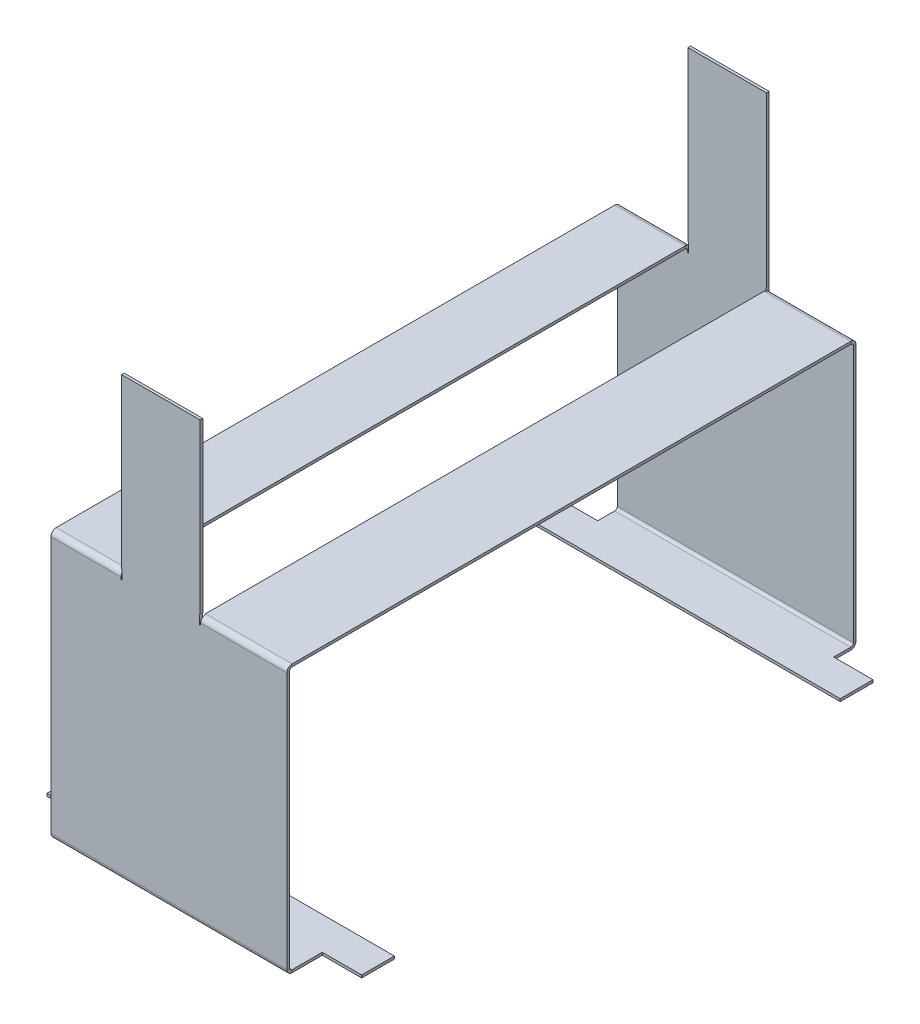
ISO-10303-21;
HEADER;
FILE_DESCRIPTION(('STEP AP214'),'2;1');
FILE_NAME('part.step','',(''),(''),'','','');
FILE_SCHEMA(('AUTOMOTIVE_DESIGN { 1 0 10303 214 1 1 1 1 }'));
ENDSEC;
DATA;
#1=APPLICATION_CONTEXT('core data for automotive mechanical design processes');
#2=APPLICATION_PROTOCOL_DEFINITION('international standard','automotive_design',2000,#1);
#3=PRODUCT_CONTEXT('',#1,'mechanical');
#4=PRODUCT('Part','Part','',(#3));
#5=PRODUCT_RELATED_PRODUCT_CATEGORY('part','',(#4));
#6=PRODUCT_DEFINITION_FORMATION('','',#4);
#7=PRODUCT_DEFINITION_CONTEXT('part definition',#1,'design');
#8=PRODUCT_DEFINITION('design','',#6,#7);
#9=PRODUCT_DEFINITION_SHAPE('','',#8);
#10=(LENGTH_UNIT() NAMED_UNIT(*) SI_UNIT(.MILLI.,.METRE.));
#11=(NAMED_UNIT(*) PLANE_ANGLE_UNIT() SI_UNIT($,.RADIAN.));
#12=(NAMED_UNIT(*) SI_UNIT($,.STERADIAN.) SOLID_ANGLE_UNIT());
#13=UNCERTAINTY_MEASURE_WITH_UNIT(LENGTH_MEASURE(1.E-05),#10,'distance_accuracy_value','');
#14=(GEOMETRIC_REPRESENTATION_CONTEXT(3) GLOBAL_UNCERTAINTY_ASSIGNED_CONTEXT((#13)) GLOBAL_UNIT_ASSIGNED_CONTEXT((#10,
#11,#12)) REPRESENTATION_CONTEXT('',''));
#15=CARTESIAN_POINT('',(0.,0.,0.));
#16=DIRECTION('',(0.,0.,1.));
#17=DIRECTION('',(1.,0.,0.));
#18=AXIS2_PLACEMENT_3D('',#15,#16,#17);
#19=CARTESIAN_POINT('',(-35.809815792,-198.,217.));
#20=DIRECTION('',(1.,0.,0.));
#21=DIRECTION('',(0.,-1.,0.));
#22=AXIS2_PLACEMENT_3D('',#19,#20,#21);
#23=PLANE('',#22);
#24=DIRECTION('',(0.,0.,1.));
#25=VECTOR('',#24,1.);
#26=CARTESIAN_POINT('',(-35.809815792,3.5,217.));
#27=LINE('',#26,#25);
#28=CARTESIAN_POINT('',(-35.809815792,3.5,215.));
#29=VERTEX_POINT('',#28);
#30=CARTESIAN_POINT('',(-35.809815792,3.5,217.));
#31=VERTEX_POINT('',#30);
#32=EDGE_CURVE('E11',#29,#31,#27,.T.);
#33=ORIENTED_EDGE('',*,*,#32,.F.);
#34=DIRECTION('',(0.,1.,0.));
#35=VECTOR('',#34,1.);
#36=CARTESIAN_POINT('',(-35.809815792,-198.,215.));
#37=LINE('',#36,#35);
#38=CARTESIAN_POINT('',(-35.809815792,-3.49999999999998,215.));
#39=VERTEX_POINT('',#38);
#40=EDGE_CURVE('E252',#29,#39,#37,.F.);
#41=ORIENTED_EDGE('',*,*,#40,.T.);
#42=DIRECTION('',(0.,0.,1.));
#43=VECTOR('',#42,1.);
#44=CARTESIAN_POINT('',(-35.809815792,-3.49999999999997,217.));
#45=LINE('',#44,#43);
#46=CARTESIAN_POINT('',(-35.809815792,-3.49999999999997,217.));
#47=VERTEX_POINT('',#46);
#48=EDGE_CURVE('E45',#39,#47,#45,.T.);
#49=ORIENTED_EDGE('',*,*,#48,.T.);
#50=DIRECTION('',(0.,-1.,0.));
#51=VECTOR('',#50,1.);
#52=CARTESIAN_POINT('',(-35.809815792,-198.,217.));
#53=LINE('',#52,#51);
#54=EDGE_CURVE('E255',#31,#47,#53,.T.);
#55=ORIENTED_EDGE('',*,*,#54,.F.);
#56=EDGE_LOOP('',(#33,#41,#49,#55));
#57=FACE_BOUND('',#56,.T.);
#58=ADVANCED_FACE('F35',(#57),#23,.F.);
#59=CARTESIAN_POINT('',(-90.,-3.49999999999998,217.));
#60=DIRECTION('',(0.,-1.,0.));
#61=DIRECTION('',(-1.,0.,0.));
#62=AXIS2_PLACEMENT_3D('',#59,#60,#61);
#63=PLANE('',#62);
#64=ORIENTED_EDGE('',*,*,#48,.F.);
#65=DIRECTION('',(1.,0.,0.));
#66=VECTOR('',#65,1.);
#67=CARTESIAN_POINT('',(-90.,-3.49999999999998,215.));
#68=LINE('',#67,#66);
#69=CARTESIAN_POINT('',(-36.509815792,-3.49999999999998,215.));
#70=VERTEX_POINT('',#69);
#71=EDGE_CURVE('E269',#39,#70,#68,.F.);
#72=ORIENTED_EDGE('',*,*,#71,.T.);
#73=DIRECTION('',(0.,0.,1.));
#74=VECTOR('',#73,1.);
#75=CARTESIAN_POINT('',(-36.509815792,-3.49999999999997,217.));
#76=LINE('',#75,#74);
#77=CARTESIAN_POINT('',(-36.509815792,-3.49999999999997,217.));
#78=VERTEX_POINT('',#77);
#79=EDGE_CURVE('E483',#70,#78,#76,.T.);
#80=ORIENTED_EDGE('',*,*,#79,.T.);
#81=DIRECTION('',(-1.,0.,0.));
#82=VECTOR('',#81,1.);
#83=CARTESIAN_POINT('',(-90.,-3.49999999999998,217.));
#84=LINE('',#83,#82);
#85=EDGE_CURVE('E497',#47,#78,#84,.T.);
#86=ORIENTED_EDGE('',*,*,#85,.F.);
#87=EDGE_LOOP('',(#64,#72,#80,#86));
#88=FACE_BOUND('',#87,.T.);
#89=ADVANCED_FACE('F502',(#88),#63,.F.);
#90=CARTESIAN_POINT('',(-36.509815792,-198.,217.));
#91=DIRECTION('',(-1.,0.,0.));
#92=DIRECTION('',(0.,1.,0.));
#93=AXIS2_PLACEMENT_3D('',#90,#91,#92);
#94=PLANE('',#93);
#95=ORIENTED_EDGE('',*,*,#79,.F.);
#96=DIRECTION('',(0.,1.,0.));
#97=VECTOR('',#96,1.);
#98=CARTESIAN_POINT('',(-36.509815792,-198.,215.));
#99=LINE('',#98,#97);
#100=CARTESIAN_POINT('',(-36.509815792,-2.,215.));
#101=VERTEX_POINT('',#100);
#102=EDGE_CURVE('E270',#70,#101,#99,.T.);
#103=ORIENTED_EDGE('',*,*,#102,.T.);
#104=DIRECTION('',(0.,0.,1.));
#105=VECTOR('',#104,1.);
#106=CARTESIAN_POINT('',(-36.509815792,-2.,217.));
#107=LINE('',#106,#105);
#108=CARTESIAN_POINT('',(-36.509815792,-2.,217.));
#109=VERTEX_POINT('',#108);
#110=EDGE_CURVE('E480',#101,#109,#107,.T.);
#111=ORIENTED_EDGE('',*,*,#110,.T.);
#112=DIRECTION('',(0.,1.,0.));
#113=VECTOR('',#112,1.);
#114=CARTESIAN_POINT('',(-36.509815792,-198.,217.));
#115=LINE('',#114,#113);
#116=EDGE_CURVE('E500',#78,#109,#115,.T.);
#117=ORIENTED_EDGE('',*,*,#116,.F.);
#118=EDGE_LOOP('',(#95,#103,#111,#117));
#119=FACE_BOUND('',#118,.T.);
#120=ADVANCED_FACE('F766',(#119),#94,.F.);
#121=CARTESIAN_POINT('',(-36.509815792,-1.99999999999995,213.));
#122=DIRECTION('',(1.,0.,0.));
#123=DIRECTION('',(0.,1.,0.));
#124=AXIS2_PLACEMENT_3D('',#121,#122,#123);
#125=PLANE('',#124);
#126=ORIENTED_EDGE('',*,*,#110,.F.);
#127=CARTESIAN_POINT('',(-36.509815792,-1.99999999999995,213.));
#128=DIRECTION('',(-1.,0.,0.));
#129=DIRECTION('',(0.,0.,1.));
#130=AXIS2_PLACEMENT_3D('',#127,#128,#129);
#131=CIRCLE('',#130,1.99999999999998);
#132=CARTESIAN_POINT('',(-36.509815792,-0.0156865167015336,213.25));
#133=VERTEX_POINT('',#132);
#134=EDGE_CURVE('E277',#133,#101,#131,.F.);
#135=ORIENTED_EDGE('',*,*,#134,.F.);
#136=DIRECTION('',(0.,0.99215674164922,0.125000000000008));
#137=VECTOR('',#136,1.);
#138=CARTESIAN_POINT('',(-36.509815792,1.96862696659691,213.5));
#139=LINE('',#138,#137);
#140=CARTESIAN_POINT('',(-36.509815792,1.96862696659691,213.5));
#141=VERTEX_POINT('',#140);
#142=EDGE_CURVE('E477',#133,#141,#139,.T.);
#143=ORIENTED_EDGE('',*,*,#142,.T.);
#144=CARTESIAN_POINT('',(-36.509815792,-1.99999999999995,213.));
#145=DIRECTION('',(-1.,0.,0.));
#146=DIRECTION('',(0.,-1.,0.));
#147=AXIS2_PLACEMENT_3D('',#144,#145,#146);
#148=CIRCLE('',#147,3.99999999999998);
#149=EDGE_CURVE('E515',#141,#109,#148,.F.);
#150=ORIENTED_EDGE('',*,*,#149,.T.);
#151=EDGE_LOOP('',(#126,#135,#143,#150));
#152=FACE_BOUND('',#151,.T.);
#153=ADVANCED_FACE('F775',(#152),#125,.T.);
#154=CARTESIAN_POINT('',(-36.334815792,1.96862696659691,213.5));
#155=DIRECTION('',(0.,0.125000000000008,-0.99215674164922));
#156=DIRECTION('',(-1.,0.,0.));
#157=AXIS2_PLACEMENT_3D('',#154,#155,#156);
#158=PLANE('',#157);
#159=ORIENTED_EDGE('',*,*,#142,.F.);
#160=DIRECTION('',(-1.,0.,0.));
#161=VECTOR('',#160,1.);
#162=CARTESIAN_POINT('',(90.,-0.0156865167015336,213.25));
#163=LINE('',#162,#161);
#164=CARTESIAN_POINT('',(-36.1598157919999,-0.0156865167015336,213.25));
#165=VERTEX_POINT('',#164);
#166=EDGE_CURVE('E274',#133,#165,#163,.F.);
#167=ORIENTED_EDGE('',*,*,#166,.T.);
#168=DIRECTION('',(0.,0.99215674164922,0.125000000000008));
#169=VECTOR('',#168,1.);
#170=CARTESIAN_POINT('',(-36.1598157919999,1.96862696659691,213.5));
#171=LINE('',#170,#169);
#172=CARTESIAN_POINT('',(-36.1598157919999,1.96862696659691,213.5));
#173=VERTEX_POINT('',#172);
#174=EDGE_CURVE('E474',#165,#173,#171,.T.);
#175=ORIENTED_EDGE('',*,*,#174,.T.);
#176=DIRECTION('',(-1.,0.,0.));
#177=VECTOR('',#176,1.);
#178=CARTESIAN_POINT('',(90.,1.96862696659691,213.5));
#179=LINE('',#178,#177);
#180=EDGE_CURVE('E512',#141,#173,#179,.F.);
#181=ORIENTED_EDGE('',*,*,#180,.F.);
#182=EDGE_LOOP('',(#159,#167,#175,#181));
#183=FACE_BOUND('',#182,.T.);
#184=ADVANCED_FACE('F1239',(#183),#158,.F.);
#185=CARTESIAN_POINT('',(-36.1598157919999,-1.99999999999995,213.));
#186=DIRECTION('',(1.,0.,0.));
#187=DIRECTION('',(0.,0.,-1.));
#188=AXIS2_PLACEMENT_3D('',#185,#186,#187);
#189=PLANE('',#188);
#190=ORIENTED_EDGE('',*,*,#174,.F.);
#191=CARTESIAN_POINT('',(-36.1598157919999,-1.99999999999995,213.));
#192=DIRECTION('',(-1.,0.,0.));
#193=DIRECTION('',(0.,0.,1.));
#194=AXIS2_PLACEMENT_3D('',#191,#192,#193);
#195=CIRCLE('',#194,1.99999999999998);
#196=CARTESIAN_POINT('',(-36.1598157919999,0.,213.));
#197=VERTEX_POINT('',#196);
#198=EDGE_CURVE('E573',#197,#165,#195,.F.);
#199=ORIENTED_EDGE('',*,*,#198,.F.);
#200=DIRECTION('',(0.,1.,0.));
#201=VECTOR('',#200,1.);
#202=CARTESIAN_POINT('',(-36.1598157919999,2.,213.));
#203=LINE('',#202,#201);
#204=CARTESIAN_POINT('',(-36.1598157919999,2.,213.));
#205=VERTEX_POINT('',#204);
#206=EDGE_CURVE('E471',#197,#205,#203,.T.);
#207=ORIENTED_EDGE('',*,*,#206,.T.);
#208=CARTESIAN_POINT('',(-36.1598157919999,-1.99999999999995,213.));
#209=DIRECTION('',(-1.,0.,0.));
#210=DIRECTION('',(0.,0.,1.));
#211=AXIS2_PLACEMENT_3D('',#208,#209,#210);
#212=CIRCLE('',#211,3.99999999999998);
#213=EDGE_CURVE('E845',#205,#173,#212,.F.);
#214=ORIENTED_EDGE('',*,*,#213,.T.);
#215=EDGE_LOOP('',(#190,#199,#207,#214));
#216=FACE_BOUND('',#215,.T.);
#217=ADVANCED_FACE('F1236',(#216),#189,.T.);
#218=CARTESIAN_POINT('',(-36.159815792,2.,0.));
#219=DIRECTION('',(1.,0.,0.));
#220=DIRECTION('',(0.,0.,-1.));
#221=AXIS2_PLACEMENT_3D('',#218,#219,#220);
#222=PLANE('',#221);
#223=ORIENTED_EDGE('',*,*,#206,.F.);
#224=DIRECTION('',(0.,0.,1.));
#225=VECTOR('',#224,1.);
#226=CARTESIAN_POINT('',(-36.1598157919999,0.,-213.));
#227=LINE('',#226,#225);
#228=CARTESIAN_POINT('',(-36.159815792,0.,-213.));
#229=VERTEX_POINT('',#228);
#230=EDGE_CURVE('E578',#197,#229,#227,.F.);
#231=ORIENTED_EDGE('',*,*,#230,.T.);
#232=DIRECTION('',(0.,1.,0.));
#233=VECTOR('',#232,1.);
#234=CARTESIAN_POINT('',(-36.159815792,2.,-213.));
#235=LINE('',#234,#233);
#236=CARTESIAN_POINT('',(-36.159815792,2.,-213.));
#237=VERTEX_POINT('',#236);
#238=EDGE_CURVE('E468',#229,#237,#235,.T.);
#239=ORIENTED_EDGE('',*,*,#238,.T.);
#240=DIRECTION('',(0.,0.,-1.));
#241=VECTOR('',#240,1.);
#242=CARTESIAN_POINT('',(-36.159815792,2.,0.));
#243=LINE('',#242,#241);
#244=EDGE_CURVE('E839',#205,#237,#243,.T.);
#245=ORIENTED_EDGE('',*,*,#244,.F.);
#246=EDGE_LOOP('',(#223,#231,#239,#245));
#247=FACE_BOUND('',#246,.T.);
#248=ADVANCED_FACE('F1230',(#247),#222,.T.);
#249=CARTESIAN_POINT('',(-36.159815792,-1.99999999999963,-213.));
#250=DIRECTION('',(1.,0.,0.));
#251=DIRECTION('',(0.,0.,-1.));
#252=AXIS2_PLACEMENT_3D('',#249,#250,#251);
#253=PLANE('',#252);
#254=ORIENTED_EDGE('',*,*,#238,.F.);
#255=CARTESIAN_POINT('',(-36.159815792,-1.99999999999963,-213.));
#256=DIRECTION('',(1.,0.,0.));
#257=DIRECTION('',(0.,0.,-1.));
#258=AXIS2_PLACEMENT_3D('',#255,#256,#257);
#259=CIRCLE('',#258,1.99999999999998);
#260=CARTESIAN_POINT('',(-36.159815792,-0.0156865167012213,-213.25));
#261=VERTEX_POINT('',#260);
#262=EDGE_CURVE('E644',#261,#229,#259,.T.);
#263=ORIENTED_EDGE('',*,*,#262,.F.);
#264=DIRECTION('',(0.,0.992156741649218,-0.125000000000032));
#265=VECTOR('',#264,1.);
#266=CARTESIAN_POINT('',(-36.159815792,1.96862696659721,-213.5));
#267=LINE('',#266,#265);
#268=CARTESIAN_POINT('',(-36.159815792,1.96862696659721,-213.5));
#269=VERTEX_POINT('',#268);
#270=EDGE_CURVE('E465',#261,#269,#267,.T.);
#271=ORIENTED_EDGE('',*,*,#270,.T.);
#272=CARTESIAN_POINT('',(-36.159815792,-1.99999999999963,-213.));
#273=DIRECTION('',(-1.,0.,0.));
#274=DIRECTION('',(0.,0.,1.));
#275=AXIS2_PLACEMENT_3D('',#272,#273,#274);
#276=CIRCLE('',#275,3.99999999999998);
#277=EDGE_CURVE('E871',#269,#237,#276,.F.);
#278=ORIENTED_EDGE('',*,*,#277,.T.);
#279=EDGE_LOOP('',(#254,#263,#271,#278));
#280=FACE_BOUND('',#279,.T.);
#281=ADVANCED_FACE('F1225',(#280),#253,.T.);
#282=CARTESIAN_POINT('',(-36.334815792,1.96862696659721,-213.5));
#283=DIRECTION('',(0.,0.125000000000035,0.992156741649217));
#284=DIRECTION('',(1.,0.,0.));
#285=AXIS2_PLACEMENT_3D('',#282,#283,#284);
#286=PLANE('',#285);
#287=ORIENTED_EDGE('',*,*,#270,.F.);
#288=DIRECTION('',(1.,0.,0.));
#289=VECTOR('',#288,1.);
#290=CARTESIAN_POINT('',(-90.,-0.0156865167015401,-213.25));
#291=LINE('',#290,#289);
#292=CARTESIAN_POINT('',(-36.509815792,-0.015686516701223,-213.25));
#293=VERTEX_POINT('',#292);
#294=EDGE_CURVE('E751',#261,#293,#291,.F.);
#295=ORIENTED_EDGE('',*,*,#294,.T.);
#296=DIRECTION('',(0.,0.992156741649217,-0.125000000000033));
#297=VECTOR('',#296,1.);
#298=CARTESIAN_POINT('',(-36.509815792,1.96862696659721,-213.5));
#299=LINE('',#298,#297);
#300=CARTESIAN_POINT('',(-36.509815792,1.96862696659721,-213.5));
#301=VERTEX_POINT('',#300);
#302=EDGE_CURVE('E462',#293,#301,#299,.T.);
#303=ORIENTED_EDGE('',*,*,#302,.T.);
#304=DIRECTION('',(1.,0.,0.));
#305=VECTOR('',#304,1.);
#306=CARTESIAN_POINT('',(-90.,1.96862696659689,-213.5));
#307=LINE('',#306,#305);
#308=EDGE_CURVE('E530',#269,#301,#307,.F.);
#309=ORIENTED_EDGE('',*,*,#308,.F.);
#310=EDGE_LOOP('',(#287,#295,#303,#309));
#311=FACE_BOUND('',#310,.T.);
#312=ADVANCED_FACE('F1184',(#311),#286,.F.);
#313=CARTESIAN_POINT('',(-36.509815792,-1.99999999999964,-213.));
#314=DIRECTION('',(1.,0.,0.));
#315=DIRECTION('',(0.,1.,0.));
#316=AXIS2_PLACEMENT_3D('',#313,#314,#315);
#317=PLANE('',#316);
#318=ORIENTED_EDGE('',*,*,#302,.F.);
#319=CARTESIAN_POINT('',(-36.509815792,-1.99999999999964,-213.));
#320=DIRECTION('',(1.,0.,0.));
#321=DIRECTION('',(0.,0.,-1.));
#322=AXIS2_PLACEMENT_3D('',#319,#320,#321);
#323=CIRCLE('',#322,1.99999999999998);
#324=CARTESIAN_POINT('',(-36.509815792,-1.99999999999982,-215.));
#325=VERTEX_POINT('',#324);
#326=EDGE_CURVE('E727',#325,#293,#323,.T.);
#327=ORIENTED_EDGE('',*,*,#326,.F.);
#328=DIRECTION('',(0.,0.,-1.));
#329=VECTOR('',#328,1.);
#330=CARTESIAN_POINT('',(-36.509815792,-2.,-217.));
#331=LINE('',#330,#329);
#332=CARTESIAN_POINT('',(-36.509815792,-2.,-217.));
#333=VERTEX_POINT('',#332);
#334=EDGE_CURVE('E459',#325,#333,#331,.T.);
#335=ORIENTED_EDGE('',*,*,#334,.T.);
#336=CARTESIAN_POINT('',(-36.509815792,-1.99999999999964,-213.));
#337=DIRECTION('',(-1.,0.,0.));
#338=DIRECTION('',(0.,-1.,0.));
#339=AXIS2_PLACEMENT_3D('',#336,#337,#338);
#340=CIRCLE('',#339,3.99999999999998);
#341=EDGE_CURVE('E533',#333,#301,#340,.F.);
#342=ORIENTED_EDGE('',*,*,#341,.T.);
#343=EDGE_LOOP('',(#318,#327,#335,#342));
#344=FACE_BOUND('',#343,.T.);
#345=ADVANCED_FACE('F1195',(#344),#317,.T.);
#346=CARTESIAN_POINT('',(-36.509815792,-1.99999999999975,-217.));
#347=DIRECTION('',(-1.,0.,0.));
#348=DIRECTION('',(0.,-1.,0.));
#349=AXIS2_PLACEMENT_3D('',#346,#347,#348);
#350=PLANE('',#349);
#351=ORIENTED_EDGE('',*,*,#334,.F.);
#352=DIRECTION('',(0.,-1.,0.));
#353=VECTOR('',#352,1.);
#354=CARTESIAN_POINT('',(-36.509815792,-2.,-215.));
#355=LINE('',#354,#353);
#356=CARTESIAN_POINT('',(-36.509815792,-3.49999999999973,-215.));
#357=VERTEX_POINT('',#356);
#358=EDGE_CURVE('E742',#325,#357,#355,.T.);
#359=ORIENTED_EDGE('',*,*,#358,.T.);
#360=DIRECTION('',(0.,0.,-1.));
#361=VECTOR('',#360,1.);
#362=CARTESIAN_POINT('',(-36.509815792,-3.49999999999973,-217.));
#363=LINE('',#362,#361);
#364=CARTESIAN_POINT('',(-36.509815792,-3.49999999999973,-217.));
#365=VERTEX_POINT('',#364);
#366=EDGE_CURVE('E456',#357,#365,#363,.T.);
#367=ORIENTED_EDGE('',*,*,#366,.T.);
#368=DIRECTION('',(0.,-1.,0.));
#369=VECTOR('',#368,1.);
#370=CARTESIAN_POINT('',(-36.509815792,-1.99999999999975,-217.));
#371=LINE('',#370,#369);
#372=EDGE_CURVE('E527',#333,#365,#371,.T.);
#373=ORIENTED_EDGE('',*,*,#372,.F.);
#374=EDGE_LOOP('',(#351,#359,#367,#373));
#375=FACE_BOUND('',#374,.T.);
#376=ADVANCED_FACE('F1198',(#375),#350,.F.);
#377=CARTESIAN_POINT('',(-90.,-3.49999999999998,-217.));
#378=DIRECTION('',(0.,-1.,0.));
#379=DIRECTION('',(1.,0.,0.));
#380=AXIS2_PLACEMENT_3D('',#377,#378,#379);
#381=PLANE('',#380);
#382=ORIENTED_EDGE('',*,*,#366,.F.);
#383=DIRECTION('',(1.,0.,0.));
#384=VECTOR('',#383,1.);
#385=CARTESIAN_POINT('',(-90.,-3.49999999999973,-215.));
#386=LINE('',#385,#384);
#387=CARTESIAN_POINT('',(-35.809815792,-3.49999999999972,-215.));
#388=VERTEX_POINT('',#387);
#389=EDGE_CURVE('E746',#357,#388,#386,.T.);
#390=ORIENTED_EDGE('',*,*,#389,.T.);
#391=DIRECTION('',(0.,0.,-1.));
#392=VECTOR('',#391,1.);
#393=CARTESIAN_POINT('',(-35.809815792,-3.49999999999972,-217.));
#394=LINE('',#393,#392);
#395=CARTESIAN_POINT('',(-35.809815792,-3.49999999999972,-217.));
#396=VERTEX_POINT('',#395);
#397=EDGE_CURVE('E453',#388,#396,#394,.T.);
#398=ORIENTED_EDGE('',*,*,#397,.T.);
#399=DIRECTION('',(1.,0.,0.));
#400=VECTOR('',#399,1.);
#401=CARTESIAN_POINT('',(-90.,-3.49999999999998,-217.));
#402=LINE('',#401,#400);
#403=EDGE_CURVE('E518',#365,#396,#402,.T.);
#404=ORIENTED_EDGE('',*,*,#403,.F.);
#405=EDGE_LOOP('',(#382,#390,#398,#404));
#406=FACE_BOUND('',#405,.T.);
#407=ADVANCED_FACE('F1208',(#406),#381,.F.);
#408=CARTESIAN_POINT('',(-35.809815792,-1.99999999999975,-217.));
#409=DIRECTION('',(1.,0.,0.));
#410=DIRECTION('',(0.,1.,0.));
#411=AXIS2_PLACEMENT_3D('',#408,#409,#410);
#412=PLANE('',#411);
#413=ORIENTED_EDGE('',*,*,#397,.F.);
#414=DIRECTION('',(0.,-1.,0.));
#415=VECTOR('',#414,1.);
#416=CARTESIAN_POINT('',(-35.809815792,-2.,-215.));
#417=LINE('',#416,#415);
#418=CARTESIAN_POINT('',(-35.809815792,3.5,-215.));
#419=VERTEX_POINT('',#418);
#420=EDGE_CURVE('E743',#388,#419,#417,.F.);
#421=ORIENTED_EDGE('',*,*,#420,.T.);
#422=DIRECTION('',(0.,0.,-1.));
#423=VECTOR('',#422,1.);
#424=CARTESIAN_POINT('',(-35.809815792,3.5,-217.));
#425=LINE('',#424,#423);
#426=CARTESIAN_POINT('',(-35.809815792,3.5,-217.));
#427=VERTEX_POINT('',#426);
#428=EDGE_CURVE('E450',#419,#427,#425,.T.);
#429=ORIENTED_EDGE('',*,*,#428,.T.);
#430=DIRECTION('',(0.,1.,0.));
#431=VECTOR('',#430,1.);
#432=CARTESIAN_POINT('',(-35.809815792,-1.99999999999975,-217.));
#433=LINE('',#432,#431);
#434=EDGE_CURVE('E521',#396,#427,#433,.T.);
#435=ORIENTED_EDGE('',*,*,#434,.F.);
#436=EDGE_LOOP('',(#413,#421,#429,#435));
#437=FACE_BOUND('',#436,.T.);
#438=ADVANCED_FACE('F1330',(#437),#412,.F.);
#439=CARTESIAN_POINT('',(-90.,3.49999999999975,-217.));
#440=DIRECTION('',(0.,1.,0.));
#441=DIRECTION('',(-1.,0.,0.));
#442=AXIS2_PLACEMENT_3D('',#439,#440,#441);
#443=PLANE('',#442);
#444=ORIENTED_EDGE('',*,*,#428,.F.);
#445=DIRECTION('',(1.,0.,0.));
#446=VECTOR('',#445,1.);
#447=CARTESIAN_POINT('',(-90.,3.5,-215.));
#448=LINE('',#447,#446);
#449=CARTESIAN_POINT('',(-36.159815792,3.5,-215.));
#450=VERTEX_POINT('',#449);
#451=EDGE_CURVE('E739',#419,#450,#448,.F.);
#452=ORIENTED_EDGE('',*,*,#451,.T.);
#453=DIRECTION('',(0.,0.,-1.));
#454=VECTOR('',#453,1.);
#455=CARTESIAN_POINT('',(-36.159815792,3.5,-217.));
#456=LINE('',#455,#454);
#457=CARTESIAN_POINT('',(-36.159815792,3.5,-217.));
#458=VERTEX_POINT('',#457);
#459=EDGE_CURVE('E447',#450,#458,#456,.T.);
#460=ORIENTED_EDGE('',*,*,#459,.T.);
#461=DIRECTION('',(-1.,0.,0.));
#462=VECTOR('',#461,1.);
#463=CARTESIAN_POINT('',(-90.,3.49999999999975,-217.));
#464=LINE('',#463,#462);
#465=EDGE_CURVE('E524',#427,#458,#464,.T.);
#466=ORIENTED_EDGE('',*,*,#465,.F.);
#467=EDGE_LOOP('',(#444,#452,#460,#466));
#468=FACE_BOUND('',#467,.T.);
#469=ADVANCED_FACE('F1340',(#468),#443,.F.);
#470=CARTESIAN_POINT('',(-36.159815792,132.,-217.));
#471=DIRECTION('',(-1.,0.,0.));
#472=DIRECTION('',(0.,-1.,0.));
#473=AXIS2_PLACEMENT_3D('',#470,#471,#472);
#474=PLANE('',#473);
#475=ORIENTED_EDGE('',*,*,#459,.F.);
#476=DIRECTION('',(0.,-1.,0.));
#477=VECTOR('',#476,1.);
#478=CARTESIAN_POINT('',(-36.159815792,-2.,-215.));
#479=LINE('',#478,#477);
#480=CARTESIAN_POINT('',(-36.159815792,132.,-215.));
#481=VERTEX_POINT('',#480);
#482=EDGE_CURVE('E582',#481,#450,#479,.T.);
#483=ORIENTED_EDGE('',*,*,#482,.F.);
#484=DIRECTION('',(0.,0.,-1.));
#485=VECTOR('',#484,1.);
#486=CARTESIAN_POINT('',(-36.159815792,132.,-217.));
#487=LINE('',#486,#485);
#488=CARTESIAN_POINT('',(-36.159815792,132.,-217.));
#489=VERTEX_POINT('',#488);
#490=EDGE_CURVE('E444',#481,#489,#487,.T.);
#491=ORIENTED_EDGE('',*,*,#490,.T.);
#492=DIRECTION('',(0.,-1.,0.));
#493=VECTOR('',#492,1.);
#494=CARTESIAN_POINT('',(-36.159815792,132.,-217.));
#495=LINE('',#494,#493);
#496=EDGE_CURVE('E865',#489,#458,#495,.T.);
#497=ORIENTED_EDGE('',*,*,#496,.T.);
#498=EDGE_LOOP('',(#475,#483,#491,#497));
#499=FACE_BOUND('',#498,.T.);
#500=ADVANCED_FACE('F1351',(#499),#474,.T.);
#501=CARTESIAN_POINT('',(-36.159815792,132.,-217.));
#502=DIRECTION('',(0.,1.,0.));
#503=DIRECTION('',(-1.,0.,0.));
#504=AXIS2_PLACEMENT_3D('',#501,#502,#503);
#505=PLANE('',#504);
#506=ORIENTED_EDGE('',*,*,#490,.F.);
#507=DIRECTION('',(1.,0.,0.));
#508=VECTOR('',#507,1.);
#509=CARTESIAN_POINT('',(-90.,132.,-215.));
#510=LINE('',#509,#508);
#511=CARTESIAN_POINT('',(23.840184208,132.,-215.));
#512=VERTEX_POINT('',#511);
#513=EDGE_CURVE('E734',#512,#481,#510,.F.);
#514=ORIENTED_EDGE('',*,*,#513,.F.);
#515=DIRECTION('',(0.,0.,-1.));
#516=VECTOR('',#515,1.);
#517=CARTESIAN_POINT('',(23.840184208,132.,-217.));
#518=LINE('',#517,#516);
#519=CARTESIAN_POINT('',(23.840184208,132.,-217.));
#520=VERTEX_POINT('',#519);
#521=EDGE_CURVE('E441',#512,#520,#518,.T.);
#522=ORIENTED_EDGE('',*,*,#521,.T.);
#523=DIRECTION('',(-1.,0.,0.));
#524=VECTOR('',#523,1.);
#525=CARTESIAN_POINT('',(-36.159815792,132.,-217.));
#526=LINE('',#525,#524);
#527=EDGE_CURVE('E868',#520,#489,#526,.T.);
#528=ORIENTED_EDGE('',*,*,#527,.T.);
#529=EDGE_LOOP('',(#506,#514,#522,#528));
#530=FACE_BOUND('',#529,.T.);
#531=ADVANCED_FACE('F1362',(#530),#505,.T.);
#532=CARTESIAN_POINT('',(23.840184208,132.,-217.));
#533=DIRECTION('',(-1.,0.,0.));
#534=DIRECTION('',(0.,-1.,0.));
#535=AXIS2_PLACEMENT_3D('',#532,#533,#534);
#536=PLANE('',#535);
#537=ORIENTED_EDGE('',*,*,#521,.F.);
#538=DIRECTION('',(0.,-1.,0.));
#539=VECTOR('',#538,1.);
#540=CARTESIAN_POINT('',(23.840184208,-2.,-215.));
#541=LINE('',#540,#539);
#542=CARTESIAN_POINT('',(23.840184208,3.5,-215.));
#543=VERTEX_POINT('',#542);
#544=EDGE_CURVE('E588',#512,#543,#541,.T.);
#545=ORIENTED_EDGE('',*,*,#544,.T.);
#546=DIRECTION('',(0.,0.,-1.));
#547=VECTOR('',#546,1.);
#548=CARTESIAN_POINT('',(23.840184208,3.5,-217.));
#549=LINE('',#548,#547);
#550=CARTESIAN_POINT('',(23.840184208,3.5,-217.));
#551=VERTEX_POINT('',#550);
#552=EDGE_CURVE('E438',#543,#551,#549,.T.);
#553=ORIENTED_EDGE('',*,*,#552,.T.);
#554=DIRECTION('',(0.,-1.,0.));
#555=VECTOR('',#554,1.);
#556=CARTESIAN_POINT('',(23.840184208,132.,-217.));
#557=LINE('',#556,#555);
#558=EDGE_CURVE('E849',#520,#551,#557,.T.);
#559=ORIENTED_EDGE('',*,*,#558,.F.);
#560=EDGE_LOOP('',(#537,#545,#553,#559));
#561=FACE_BOUND('',#560,.T.);
#562=ADVANCED_FACE('F1373',(#561),#536,.F.);
#563=CARTESIAN_POINT('',(-90.,3.50000000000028,-217.));
#564=DIRECTION('',(0.,1.,0.));
#565=DIRECTION('',(-1.,0.,0.));
#566=AXIS2_PLACEMENT_3D('',#563,#564,#565);
#567=PLANE('',#566);
#568=ORIENTED_EDGE('',*,*,#552,.F.);
#569=DIRECTION('',(1.,0.,0.));
#570=VECTOR('',#569,1.);
#571=CARTESIAN_POINT('',(-90.,3.5,-215.));
#572=LINE('',#571,#570);
#573=CARTESIAN_POINT('',(23.490184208,3.5,-215.));
#574=VERTEX_POINT('',#573);
#575=EDGE_CURVE('E716',#543,#574,#572,.F.);
#576=ORIENTED_EDGE('',*,*,#575,.T.);
#577=DIRECTION('',(0.,0.,-1.));
#578=VECTOR('',#577,1.);
#579=CARTESIAN_POINT('',(23.490184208,3.5,-217.));
#580=LINE('',#579,#578);
#581=CARTESIAN_POINT('',(23.490184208,3.5,-217.));
#582=VERTEX_POINT('',#581);
#583=EDGE_CURVE('E435',#574,#582,#580,.T.);
#584=ORIENTED_EDGE('',*,*,#583,.T.);
#585=DIRECTION('',(-1.,0.,0.));
#586=VECTOR('',#585,1.);
#587=CARTESIAN_POINT('',(-90.,3.50000000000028,-217.));
#588=LINE('',#587,#586);
#589=EDGE_CURVE('E545',#551,#582,#588,.T.);
#590=ORIENTED_EDGE('',*,*,#589,.F.);
#591=EDGE_LOOP('',(#568,#576,#584,#590));
#592=FACE_BOUND('',#591,.T.);
#593=ADVANCED_FACE('F1081',(#592),#567,.F.);
#594=CARTESIAN_POINT('',(23.490184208,-2.00000000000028,-217.));
#595=DIRECTION('',(-1.,0.,0.));
#596=DIRECTION('',(0.,-1.,0.));
#597=AXIS2_PLACEMENT_3D('',#594,#595,#596);
#598=PLANE('',#597);
#599=ORIENTED_EDGE('',*,*,#583,.F.);
#600=DIRECTION('',(0.,-1.,0.));
#601=VECTOR('',#600,1.);
#602=CARTESIAN_POINT('',(23.490184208,-2.,-215.));
#603=LINE('',#602,#601);
#604=CARTESIAN_POINT('',(23.490184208,-3.49999999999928,-215.));
#605=VERTEX_POINT('',#604);
#606=EDGE_CURVE('E723',#574,#605,#603,.T.);
#607=ORIENTED_EDGE('',*,*,#606,.T.);
#608=DIRECTION('',(0.,0.,-1.));
#609=VECTOR('',#608,1.);
#610=CARTESIAN_POINT('',(23.490184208,-3.49999999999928,-217.));
#611=LINE('',#610,#609);
#612=CARTESIAN_POINT('',(23.490184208,-3.49999999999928,-217.));
#613=VERTEX_POINT('',#612);
#614=EDGE_CURVE('E432',#605,#613,#611,.T.);
#615=ORIENTED_EDGE('',*,*,#614,.T.);
#616=DIRECTION('',(0.,-1.,0.));
#617=VECTOR('',#616,1.);
#618=CARTESIAN_POINT('',(23.490184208,-2.00000000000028,-217.));
#619=LINE('',#618,#617);
#620=EDGE_CURVE('E542',#582,#613,#619,.T.);
#621=ORIENTED_EDGE('',*,*,#620,.F.);
#622=EDGE_LOOP('',(#599,#607,#615,#621));
#623=FACE_BOUND('',#622,.T.);
#624=ADVANCED_FACE('F1091',(#623),#598,.F.);
#625=CARTESIAN_POINT('',(-90.,-3.499999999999,-217.));
#626=DIRECTION('',(0.,-1.,0.));
#627=DIRECTION('',(1.,0.,0.));
#628=AXIS2_PLACEMENT_3D('',#625,#626,#627);
#629=PLANE('',#628);
#630=ORIENTED_EDGE('',*,*,#614,.F.);
#631=DIRECTION('',(1.,0.,0.));
#632=VECTOR('',#631,1.);
#633=CARTESIAN_POINT('',(-90.,-3.49999999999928,-215.));
#634=LINE('',#633,#632);
#635=CARTESIAN_POINT('',(24.190184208,-3.49999999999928,-215.));
#636=VERTEX_POINT('',#635);
#637=EDGE_CURVE('E724',#605,#636,#634,.T.);
#638=ORIENTED_EDGE('',*,*,#637,.T.);
#639=DIRECTION('',(0.,0.,-1.));
#640=VECTOR('',#639,1.);
#641=CARTESIAN_POINT('',(24.190184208,-3.49999999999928,-217.));
#642=LINE('',#641,#640);
#643=CARTESIAN_POINT('',(24.190184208,-3.49999999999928,-217.));
#644=VERTEX_POINT('',#643);
#645=EDGE_CURVE('E429',#636,#644,#642,.T.);
#646=ORIENTED_EDGE('',*,*,#645,.T.);
#647=DIRECTION('',(1.,0.,0.));
#648=VECTOR('',#647,1.);
#649=CARTESIAN_POINT('',(-90.,-3.499999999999,-217.));
#650=LINE('',#649,#648);
#651=EDGE_CURVE('E536',#613,#644,#650,.T.);
#652=ORIENTED_EDGE('',*,*,#651,.F.);
#653=EDGE_LOOP('',(#630,#638,#646,#652));
#654=FACE_BOUND('',#653,.T.);
#655=ADVANCED_FACE('F1094',(#654),#629,.F.);
#656=CARTESIAN_POINT('',(24.190184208,-2.00000000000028,-217.));
#657=DIRECTION('',(1.,0.,0.));
#658=DIRECTION('',(0.,1.,0.));
#659=AXIS2_PLACEMENT_3D('',#656,#657,#658);
#660=PLANE('',#659);
#661=ORIENTED_EDGE('',*,*,#645,.F.);
#662=DIRECTION('',(0.,-1.,0.));
#663=VECTOR('',#662,1.);
#664=CARTESIAN_POINT('',(24.190184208,-2.,-215.));
#665=LINE('',#664,#663);
#666=CARTESIAN_POINT('',(24.190184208,-2.,-215.));
#667=VERTEX_POINT('',#666);
#668=EDGE_CURVE('E720',#636,#667,#665,.F.);
#669=ORIENTED_EDGE('',*,*,#668,.T.);
#670=DIRECTION('',(0.,-1.80788403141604E-13,-1.));
#671=VECTOR('',#670,1.);
#672=CARTESIAN_POINT('',(24.190184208,-2.,-217.));
#673=LINE('',#672,#671);
#674=CARTESIAN_POINT('',(24.190184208,-2.,-217.));
#675=VERTEX_POINT('',#674);
#676=EDGE_CURVE('E426',#667,#675,#673,.T.);
#677=ORIENTED_EDGE('',*,*,#676,.T.);
#678=DIRECTION('',(0.,1.,0.));
#679=VECTOR('',#678,1.);
#680=CARTESIAN_POINT('',(24.190184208,-2.00000000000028,-217.));
#681=LINE('',#680,#679);
#682=EDGE_CURVE('E539',#644,#675,#681,.T.);
#683=ORIENTED_EDGE('',*,*,#682,.F.);
#684=EDGE_LOOP('',(#661,#669,#677,#683));
#685=FACE_BOUND('',#684,.T.);
#686=ADVANCED_FACE('F1100',(#685),#660,.F.);
#687=CARTESIAN_POINT('',(24.190184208,-1.99999999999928,-213.000000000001));
#688=DIRECTION('',(-1.,0.,0.));
#689=DIRECTION('',(0.,-1.,0.));
#690=AXIS2_PLACEMENT_3D('',#687,#688,#689);
#691=PLANE('',#690);
#692=ORIENTED_EDGE('',*,*,#676,.F.);
#693=CARTESIAN_POINT('',(24.190184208,-1.99999999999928,-213.000000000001));
#694=DIRECTION('',(1.,0.,0.));
#695=DIRECTION('',(0.,0.,-1.));
#696=AXIS2_PLACEMENT_3D('',#693,#694,#695);
#697=CIRCLE('',#696,1.99999999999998);
#698=CARTESIAN_POINT('',(24.190184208,-0.0156865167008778,-213.250000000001));
#699=VERTEX_POINT('',#698);
#700=EDGE_CURVE('E715',#699,#667,#697,.F.);
#701=ORIENTED_EDGE('',*,*,#700,.F.);
#702=DIRECTION('',(0.,0.99215674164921,-0.125000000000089));
#703=VECTOR('',#702,1.);
#704=CARTESIAN_POINT('',(24.190184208,1.96862696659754,-213.500000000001));
#705=LINE('',#704,#703);
#706=CARTESIAN_POINT('',(24.190184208,1.96862696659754,-213.500000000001));
#707=VERTEX_POINT('',#706);
#708=EDGE_CURVE('E53',#699,#707,#705,.T.);
#709=ORIENTED_EDGE('',*,*,#708,.T.);
#710=CARTESIAN_POINT('',(24.190184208,-1.99999999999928,-213.000000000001));
#711=DIRECTION('',(1.,0.,0.));
#712=DIRECTION('',(0.,1.,0.));
#713=AXIS2_PLACEMENT_3D('',#710,#711,#712);
#714=CIRCLE('',#713,3.99999999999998);
#715=EDGE_CURVE('E389',#707,#675,#714,.F.);
#716=ORIENTED_EDGE('',*,*,#715,.T.);
#717=EDGE_LOOP('',(#692,#701,#709,#716));
#718=FACE_BOUND('',#717,.T.);
#719=ADVANCED_FACE('F1067',(#718),#691,.T.);
#720=CARTESIAN_POINT('',(24.015184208,1.96862696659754,-213.500000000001));
#721=DIRECTION('',(0.,0.125000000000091,0.99215674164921));
#722=DIRECTION('',(1.,0.,0.));
#723=AXIS2_PLACEMENT_3D('',#720,#721,#722);
#724=PLANE('',#723);
#725=ORIENTED_EDGE('',*,*,#708,.F.);
#726=DIRECTION('',(1.,0.,0.));
#727=VECTOR('',#726,1.);
#728=CARTESIAN_POINT('',(-90.,-0.0156865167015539,-213.25));
#729=LINE('',#728,#727);
#730=CARTESIAN_POINT('',(23.840184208,-0.0156865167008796,-213.250000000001));
#731=VERTEX_POINT('',#730);
#732=EDGE_CURVE('E712',#699,#731,#729,.F.);
#733=ORIENTED_EDGE('',*,*,#732,.T.);
#734=DIRECTION('',(0.,0.99215674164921,-0.125000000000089));
#735=VECTOR('',#734,1.);
#736=CARTESIAN_POINT('',(23.840184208,1.96862696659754,-213.500000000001));
#737=LINE('',#736,#735);
#738=CARTESIAN_POINT('',(23.840184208,1.96862696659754,-213.500000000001));
#739=VERTEX_POINT('',#738);
#740=EDGE_CURVE('E423',#731,#739,#737,.T.);
#741=ORIENTED_EDGE('',*,*,#740,.T.);
#742=DIRECTION('',(1.,0.,0.));
#743=VECTOR('',#742,1.);
#744=CARTESIAN_POINT('',(-90.,1.96862696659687,-213.5));
#745=LINE('',#744,#743);
#746=EDGE_CURVE('E548',#707,#739,#745,.F.);
#747=ORIENTED_EDGE('',*,*,#746,.F.);
#748=EDGE_LOOP('',(#725,#733,#741,#747));
#749=FACE_BOUND('',#748,.T.);
#750=ADVANCED_FACE('F1061',(#749),#724,.F.);
#751=CARTESIAN_POINT('',(23.840184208,-1.99999999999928,-213.000000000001));
#752=DIRECTION('',(-1.,0.,0.));
#753=DIRECTION('',(0.,0.,1.));
#754=AXIS2_PLACEMENT_3D('',#751,#752,#753);
#755=PLANE('',#754);
#756=ORIENTED_EDGE('',*,*,#740,.F.);
#757=CARTESIAN_POINT('',(23.840184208,-1.99999999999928,-213.000000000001));
#758=DIRECTION('',(1.,0.,0.));
#759=DIRECTION('',(0.,0.,-1.));
#760=AXIS2_PLACEMENT_3D('',#757,#758,#759);
#761=CIRCLE('',#760,1.99999999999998);
#762=CARTESIAN_POINT('',(23.840184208,6.99527241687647E-13,-213.000000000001));
#763=VERTEX_POINT('',#762);
#764=EDGE_CURVE('E643',#763,#731,#761,.F.);
#765=ORIENTED_EDGE('',*,*,#764,.F.);
#766=DIRECTION('',(0.,1.,0.));
#767=VECTOR('',#766,1.);
#768=CARTESIAN_POINT('',(23.840184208,2.,-213.000000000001));
#769=LINE('',#768,#767);
#770=CARTESIAN_POINT('',(23.840184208,2.,-213.000000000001));
#771=VERTEX_POINT('',#770);
#772=EDGE_CURVE('E420',#763,#771,#769,.T.);
#773=ORIENTED_EDGE('',*,*,#772,.T.);
#774=CARTESIAN_POINT('',(23.840184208,-1.99999999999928,-213.000000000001));
#775=DIRECTION('',(1.,0.,0.));
#776=DIRECTION('',(0.,0.,-1.));
#777=AXIS2_PLACEMENT_3D('',#774,#775,#776);
#778=CIRCLE('',#777,3.99999999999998);
#779=EDGE_CURVE('E877',#771,#739,#778,.F.);
#780=ORIENTED_EDGE('',*,*,#779,.T.);
#781=EDGE_LOOP('',(#756,#765,#773,#780));
#782=FACE_BOUND('',#781,.T.);
#783=ADVANCED_FACE('F1055',(#782),#755,.T.);
#784=CARTESIAN_POINT('',(23.840184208,2.,0.));
#785=DIRECTION('',(-1.,0.,0.));
#786=DIRECTION('',(0.,0.,1.));
#787=AXIS2_PLACEMENT_3D('',#784,#785,#786);
#788=PLANE('',#787);
#789=ORIENTED_EDGE('',*,*,#772,.F.);
#790=DIRECTION('',(0.,0.,1.));
#791=VECTOR('',#790,1.);
#792=CARTESIAN_POINT('',(23.840184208,0.,-213.));
#793=LINE('',#792,#791);
#794=CARTESIAN_POINT('',(23.8401842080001,0.,213.));
#795=VERTEX_POINT('',#794);
#796=EDGE_CURVE('E605',#763,#795,#793,.T.);
#797=ORIENTED_EDGE('',*,*,#796,.T.);
#798=DIRECTION('',(0.,1.,0.));
#799=VECTOR('',#798,1.);
#800=CARTESIAN_POINT('',(23.8401842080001,2.,213.));
#801=LINE('',#800,#799);
#802=CARTESIAN_POINT('',(23.8401842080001,2.,213.));
#803=VERTEX_POINT('',#802);
#804=EDGE_CURVE('E417',#795,#803,#801,.T.);
#805=ORIENTED_EDGE('',*,*,#804,.T.);
#806=DIRECTION('',(0.,0.,1.));
#807=VECTOR('',#806,1.);
#808=CARTESIAN_POINT('',(23.840184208,2.,0.));
#809=LINE('',#808,#807);
#810=EDGE_CURVE('E820',#771,#803,#809,.T.);
#811=ORIENTED_EDGE('',*,*,#810,.F.);
#812=EDGE_LOOP('',(#789,#797,#805,#811));
#813=FACE_BOUND('',#812,.T.);
#814=ADVANCED_FACE('F1048',(#813),#788,.T.);
#815=CARTESIAN_POINT('',(23.840184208,-1.99999999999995,213.));
#816=DIRECTION('',(-1.,0.,0.));
#817=DIRECTION('',(0.,0.,1.));
#818=AXIS2_PLACEMENT_3D('',#815,#816,#817);
#819=PLANE('',#818);
#820=ORIENTED_EDGE('',*,*,#804,.F.);
#821=CARTESIAN_POINT('',(23.840184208,-1.99999999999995,213.));
#822=DIRECTION('',(-1.,0.,0.));
#823=DIRECTION('',(0.,0.,1.));
#824=AXIS2_PLACEMENT_3D('',#821,#822,#823);
#825=CIRCLE('',#824,1.99999999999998);
#826=CARTESIAN_POINT('',(23.840184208,-0.0156865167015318,213.25));
#827=VERTEX_POINT('',#826);
#828=EDGE_CURVE('E600',#827,#795,#825,.T.);
#829=ORIENTED_EDGE('',*,*,#828,.F.);
#830=DIRECTION('',(0.,0.992156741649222,0.125000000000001));
#831=VECTOR('',#830,1.);
#832=CARTESIAN_POINT('',(23.840184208,1.96862696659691,213.5));
#833=LINE('',#832,#831);
#834=CARTESIAN_POINT('',(23.840184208,1.96862696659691,213.5));
#835=VERTEX_POINT('',#834);
#836=EDGE_CURVE('E414',#827,#835,#833,.T.);
#837=ORIENTED_EDGE('',*,*,#836,.T.);
#838=CARTESIAN_POINT('',(23.840184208,-1.99999999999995,213.));
#839=DIRECTION('',(1.,0.,0.));
#840=DIRECTION('',(0.,0.,-1.));
#841=AXIS2_PLACEMENT_3D('',#838,#839,#840);
#842=CIRCLE('',#841,3.99999999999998);
#843=EDGE_CURVE('E833',#835,#803,#842,.F.);
#844=ORIENTED_EDGE('',*,*,#843,.T.);
#845=EDGE_LOOP('',(#820,#829,#837,#844));
#846=FACE_BOUND('',#845,.T.);
#847=ADVANCED_FACE('F1041',(#846),#819,.T.);
#848=CARTESIAN_POINT('',(24.0151842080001,1.96862696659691,213.5));
#849=DIRECTION('',(0.,0.125000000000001,-0.992156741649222));
#850=DIRECTION('',(-1.,0.,0.));
#851=AXIS2_PLACEMENT_3D('',#848,#849,#850);
#852=PLANE('',#851);
#853=ORIENTED_EDGE('',*,*,#836,.F.);
#854=DIRECTION('',(-1.,0.,0.));
#855=VECTOR('',#854,1.);
#856=CARTESIAN_POINT('',(90.,-0.0156865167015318,213.25));
#857=LINE('',#856,#855);
#858=CARTESIAN_POINT('',(24.1901842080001,-0.0156865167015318,213.25));
#859=VERTEX_POINT('',#858);
#860=EDGE_CURVE('E700',#827,#859,#857,.F.);
#861=ORIENTED_EDGE('',*,*,#860,.T.);
#862=DIRECTION('',(0.,0.992156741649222,0.125000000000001));
#863=VECTOR('',#862,1.);
#864=CARTESIAN_POINT('',(24.1901842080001,1.96862696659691,213.5));
#865=LINE('',#864,#863);
#866=CARTESIAN_POINT('',(24.1901842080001,1.96862696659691,213.5));
#867=VERTEX_POINT('',#866);
#868=EDGE_CURVE('E411',#859,#867,#865,.T.);
#869=ORIENTED_EDGE('',*,*,#868,.T.);
#870=DIRECTION('',(-1.,0.,0.));
#871=VECTOR('',#870,1.);
#872=CARTESIAN_POINT('',(90.,1.96862696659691,213.5));
#873=LINE('',#872,#871);
#874=EDGE_CURVE('E507',#835,#867,#873,.F.);
#875=ORIENTED_EDGE('',*,*,#874,.F.);
#876=EDGE_LOOP('',(#853,#861,#869,#875));
#877=FACE_BOUND('',#876,.T.);
#878=ADVANCED_FACE('F1045',(#877),#852,.F.);
#879=CARTESIAN_POINT('',(24.1901842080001,-1.99999999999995,213.));
#880=DIRECTION('',(-1.,0.,0.));
#881=DIRECTION('',(0.,-1.,0.));
#882=AXIS2_PLACEMENT_3D('',#879,#880,#881);
#883=PLANE('',#882);
#884=ORIENTED_EDGE('',*,*,#868,.F.);
#885=CARTESIAN_POINT('',(24.1901842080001,-1.99999999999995,213.));
#886=DIRECTION('',(-1.,0.,0.));
#887=DIRECTION('',(0.,0.,1.));
#888=AXIS2_PLACEMENT_3D('',#885,#886,#887);
#889=CIRCLE('',#888,1.99999999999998);
#890=CARTESIAN_POINT('',(24.1901842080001,-1.99999999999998,215.));
#891=VERTEX_POINT('',#890);
#892=EDGE_CURVE('E701',#891,#859,#889,.T.);
#893=ORIENTED_EDGE('',*,*,#892,.F.);
#894=DIRECTION('',(0.,0.,1.));
#895=VECTOR('',#894,1.);
#896=CARTESIAN_POINT('',(24.1901842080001,-2.,217.));
#897=LINE('',#896,#895);
#898=CARTESIAN_POINT('',(24.1901842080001,-2.,217.));
#899=VERTEX_POINT('',#898);
#900=EDGE_CURVE('E408',#891,#899,#897,.T.);
#901=ORIENTED_EDGE('',*,*,#900,.T.);
#902=CARTESIAN_POINT('',(24.1901842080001,-1.99999999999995,213.));
#903=DIRECTION('',(1.,0.,0.));
#904=DIRECTION('',(0.,1.,0.));
#905=AXIS2_PLACEMENT_3D('',#902,#903,#904);
#906=CIRCLE('',#905,3.99999999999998);
#907=EDGE_CURVE('E503',#899,#867,#906,.F.);
#908=ORIENTED_EDGE('',*,*,#907,.T.);
#909=EDGE_LOOP('',(#884,#893,#901,#908));
#910=FACE_BOUND('',#909,.T.);
#911=ADVANCED_FACE('F993',(#910),#883,.T.);
#912=CARTESIAN_POINT('',(24.1901842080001,-198.,217.));
#913=DIRECTION('',(1.,0.,0.));
#914=DIRECTION('',(0.,-1.,0.));
#915=AXIS2_PLACEMENT_3D('',#912,#913,#914);
#916=PLANE('',#915);
#917=ORIENTED_EDGE('',*,*,#900,.F.);
#918=DIRECTION('',(0.,1.,0.));
#919=VECTOR('',#918,1.);
#920=CARTESIAN_POINT('',(24.1901842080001,-198.,215.));
#921=LINE('',#920,#919);
#922=CARTESIAN_POINT('',(24.1901842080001,-3.49999999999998,215.));
#923=VERTEX_POINT('',#922);
#924=EDGE_CURVE('E692',#891,#923,#921,.F.);
#925=ORIENTED_EDGE('',*,*,#924,.T.);
#926=DIRECTION('',(0.,0.,1.));
#927=VECTOR('',#926,1.);
#928=CARTESIAN_POINT('',(24.1901842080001,-3.49999999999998,217.));
#929=LINE('',#928,#927);
#930=CARTESIAN_POINT('',(24.1901842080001,-3.49999999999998,217.));
#931=VERTEX_POINT('',#930);
#932=EDGE_CURVE('E405',#923,#931,#929,.T.);
#933=ORIENTED_EDGE('',*,*,#932,.T.);
#934=DIRECTION('',(0.,-1.,0.));
#935=VECTOR('',#934,1.);
#936=CARTESIAN_POINT('',(24.1901842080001,-198.,217.));
#937=LINE('',#936,#935);
#938=EDGE_CURVE('E980',#899,#931,#937,.T.);
#939=ORIENTED_EDGE('',*,*,#938,.F.);
#940=EDGE_LOOP('',(#917,#925,#933,#939));
#941=FACE_BOUND('',#940,.T.);
#942=ADVANCED_FACE('F1000',(#941),#916,.F.);
#943=CARTESIAN_POINT('',(-90.,-3.49999999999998,217.));
#944=DIRECTION('',(0.,-1.,0.));
#945=DIRECTION('',(-1.,0.,0.));
#946=AXIS2_PLACEMENT_3D('',#943,#944,#945);
#947=PLANE('',#946);
#948=ORIENTED_EDGE('',*,*,#932,.F.);
#949=DIRECTION('',(1.,0.,0.));
#950=VECTOR('',#949,1.);
#951=CARTESIAN_POINT('',(-90.,-3.49999999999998,215.));
#952=LINE('',#951,#950);
#953=CARTESIAN_POINT('',(23.4901842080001,-3.49999999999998,215.));
#954=VERTEX_POINT('',#953);
#955=EDGE_CURVE('E632',#923,#954,#952,.F.);
#956=ORIENTED_EDGE('',*,*,#955,.T.);
#957=DIRECTION('',(0.,0.,1.));
#958=VECTOR('',#957,1.);
#959=CARTESIAN_POINT('',(23.4901842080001,-3.49999999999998,217.));
#960=LINE('',#959,#958);
#961=CARTESIAN_POINT('',(23.4901842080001,-3.49999999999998,217.));
#962=VERTEX_POINT('',#961);
#963=EDGE_CURVE('E402',#954,#962,#960,.T.);
#964=ORIENTED_EDGE('',*,*,#963,.T.);
#965=DIRECTION('',(-1.,0.,0.));
#966=VECTOR('',#965,1.);
#967=CARTESIAN_POINT('',(-90.,-3.49999999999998,217.));
#968=LINE('',#967,#966);
#969=EDGE_CURVE('E971',#931,#962,#968,.T.);
#970=ORIENTED_EDGE('',*,*,#969,.F.);
#971=EDGE_LOOP('',(#948,#956,#964,#970));
#972=FACE_BOUND('',#971,.T.);
#973=ADVANCED_FACE('F1012',(#972),#947,.F.);
#974=CARTESIAN_POINT('',(23.490184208,-198.,217.));
#975=DIRECTION('',(-1.,0.,0.));
#976=DIRECTION('',(0.,1.,0.));
#977=AXIS2_PLACEMENT_3D('',#974,#975,#976);
#978=PLANE('',#977);
#979=ORIENTED_EDGE('',*,*,#963,.F.);
#980=DIRECTION('',(0.,1.,0.));
#981=VECTOR('',#980,1.);
#982=CARTESIAN_POINT('',(23.4901842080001,-198.,215.));
#983=LINE('',#982,#981);
#984=CARTESIAN_POINT('',(23.4901842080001,3.5,215.));
#985=VERTEX_POINT('',#984);
#986=EDGE_CURVE('E693',#954,#985,#983,.T.);
#987=ORIENTED_EDGE('',*,*,#986,.T.);
#988=DIRECTION('',(0.,0.,1.));
#989=VECTOR('',#988,1.);
#990=CARTESIAN_POINT('',(23.4901842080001,3.5,217.));
#991=LINE('',#990,#989);
#992=CARTESIAN_POINT('',(23.4901842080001,3.5,217.));
#993=VERTEX_POINT('',#992);
#994=EDGE_CURVE('E399',#985,#993,#991,.T.);
#995=ORIENTED_EDGE('',*,*,#994,.T.);
#996=DIRECTION('',(0.,1.,0.));
#997=VECTOR('',#996,1.);
#998=CARTESIAN_POINT('',(23.490184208,-198.,217.));
#999=LINE('',#998,#997);
#1000=EDGE_CURVE('E974',#962,#993,#999,.T.);
#1001=ORIENTED_EDGE('',*,*,#1000,.F.);
#1002=EDGE_LOOP('',(#979,#987,#995,#1001));
#1003=FACE_BOUND('',#1002,.T.);
#1004=ADVANCED_FACE('F1502',(#1003),#978,.F.);
#1005=CARTESIAN_POINT('',(-90.,3.5,217.));
#1006=DIRECTION('',(0.,1.,0.));
#1007=DIRECTION('',(1.,0.,0.));
#1008=AXIS2_PLACEMENT_3D('',#1005,#1006,#1007);
#1009=PLANE('',#1008);
#1010=ORIENTED_EDGE('',*,*,#994,.F.);
#1011=DIRECTION('',(1.,0.,0.));
#1012=VECTOR('',#1011,1.);
#1013=CARTESIAN_POINT('',(-90.,3.5,215.));
#1014=LINE('',#1013,#1012);
#1015=CARTESIAN_POINT('',(23.8401842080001,3.5,215.));
#1016=VERTEX_POINT('',#1015);
#1017=EDGE_CURVE('E689',#985,#1016,#1014,.T.);
#1018=ORIENTED_EDGE('',*,*,#1017,.T.);
#1019=DIRECTION('',(0.,0.,1.));
#1020=VECTOR('',#1019,1.);
#1021=CARTESIAN_POINT('',(23.8401842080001,3.5,217.));
#1022=LINE('',#1021,#1020);
#1023=CARTESIAN_POINT('',(23.8401842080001,3.5,217.));
#1024=VERTEX_POINT('',#1023);
#1025=EDGE_CURVE('E396',#1016,#1024,#1022,.T.);
#1026=ORIENTED_EDGE('',*,*,#1025,.T.);
#1027=DIRECTION('',(1.,0.,0.));
#1028=VECTOR('',#1027,1.);
#1029=CARTESIAN_POINT('',(-90.,3.5,217.));
#1030=LINE('',#1029,#1028);
#1031=EDGE_CURVE('E977',#993,#1024,#1030,.T.);
#1032=ORIENTED_EDGE('',*,*,#1031,.F.);
#1033=EDGE_LOOP('',(#1010,#1018,#1026,#1032));
#1034=FACE_BOUND('',#1033,.T.);
#1035=ADVANCED_FACE('F1512',(#1034),#1009,.F.);
#1036=CARTESIAN_POINT('',(23.8401842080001,132.,217.));
#1037=DIRECTION('',(1.,0.,0.));
#1038=DIRECTION('',(0.,-1.,0.));
#1039=AXIS2_PLACEMENT_3D('',#1036,#1037,#1038);
#1040=PLANE('',#1039);
#1041=ORIENTED_EDGE('',*,*,#1025,.F.);
#1042=DIRECTION('',(0.,1.,0.));
#1043=VECTOR('',#1042,1.);
#1044=CARTESIAN_POINT('',(23.8401842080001,-198.,215.));
#1045=LINE('',#1044,#1043);
#1046=CARTESIAN_POINT('',(23.8401842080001,132.,215.));
#1047=VERTEX_POINT('',#1046);
#1048=EDGE_CURVE('E569',#1047,#1016,#1045,.F.);
#1049=ORIENTED_EDGE('',*,*,#1048,.F.);
#1050=DIRECTION('',(0.,0.,1.));
#1051=VECTOR('',#1050,1.);
#1052=CARTESIAN_POINT('',(23.8401842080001,132.,217.));
#1053=LINE('',#1052,#1051);
#1054=CARTESIAN_POINT('',(23.8401842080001,132.,217.));
#1055=VERTEX_POINT('',#1054);
#1056=EDGE_CURVE('E393',#1047,#1055,#1053,.T.);
#1057=ORIENTED_EDGE('',*,*,#1056,.T.);
#1058=DIRECTION('',(0.,-1.,0.));
#1059=VECTOR('',#1058,1.);
#1060=CARTESIAN_POINT('',(23.8401842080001,132.,217.));
#1061=LINE('',#1060,#1059);
#1062=EDGE_CURVE('E799',#1055,#1024,#1061,.T.);
#1063=ORIENTED_EDGE('',*,*,#1062,.T.);
#1064=EDGE_LOOP('',(#1041,#1049,#1057,#1063));
#1065=FACE_BOUND('',#1064,.T.);
#1066=ADVANCED_FACE('F1523',(#1065),#1040,.T.);
#1067=CARTESIAN_POINT('',(23.8401842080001,132.,217.));
#1068=DIRECTION('',(0.,1.,0.));
#1069=DIRECTION('',(1.,0.,0.));
#1070=AXIS2_PLACEMENT_3D('',#1067,#1068,#1069);
#1071=PLANE('',#1070);
#1072=ORIENTED_EDGE('',*,*,#1056,.F.);
#1073=DIRECTION('',(1.,0.,0.));
#1074=VECTOR('',#1073,1.);
#1075=CARTESIAN_POINT('',(-90.,132.,215.));
#1076=LINE('',#1075,#1074);
#1077=CARTESIAN_POINT('',(-36.159815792,132.,215.));
#1078=VERTEX_POINT('',#1077);
#1079=EDGE_CURVE('E684',#1078,#1047,#1076,.T.);
#1080=ORIENTED_EDGE('',*,*,#1079,.F.);
#1081=DIRECTION('',(0.,0.,1.));
#1082=VECTOR('',#1081,1.);
#1083=CARTESIAN_POINT('',(-36.159815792,132.,217.));
#1084=LINE('',#1083,#1082);
#1085=CARTESIAN_POINT('',(-36.159815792,132.,217.));
#1086=VERTEX_POINT('',#1085);
#1087=EDGE_CURVE('E390',#1078,#1086,#1084,.T.);
#1088=ORIENTED_EDGE('',*,*,#1087,.T.);
#1089=DIRECTION('',(1.,0.,0.));
#1090=VECTOR('',#1089,1.);
#1091=CARTESIAN_POINT('',(23.8401842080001,132.,217.));
#1092=LINE('',#1091,#1090);
#1093=EDGE_CURVE('E807',#1086,#1055,#1092,.T.);
#1094=ORIENTED_EDGE('',*,*,#1093,.T.);
#1095=EDGE_LOOP('',(#1072,#1080,#1088,#1094));
#1096=FACE_BOUND('',#1095,.T.);
#1097=ADVANCED_FACE('F1534',(#1096),#1071,.T.);
#1098=CARTESIAN_POINT('',(-36.159815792,132.,217.));
#1099=DIRECTION('',(1.,0.,0.));
#1100=DIRECTION('',(0.,-1.,0.));
#1101=AXIS2_PLACEMENT_3D('',#1098,#1099,#1100);
#1102=PLANE('',#1101);
#1103=ORIENTED_EDGE('',*,*,#1087,.F.);
#1104=DIRECTION('',(0.,1.,0.));
#1105=VECTOR('',#1104,1.);
#1106=CARTESIAN_POINT('',(-36.159815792,-198.,215.));
#1107=LINE('',#1106,#1105);
#1108=CARTESIAN_POINT('',(-36.159815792,3.5,215.));
#1109=VERTEX_POINT('',#1108);
#1110=EDGE_CURVE('E565',#1078,#1109,#1107,.F.);
#1111=ORIENTED_EDGE('',*,*,#1110,.T.);
#1112=DIRECTION('',(0.,0.,1.));
#1113=VECTOR('',#1112,1.);
#1114=CARTESIAN_POINT('',(-36.159815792,3.5,217.));
#1115=LINE('',#1114,#1113);
#1116=CARTESIAN_POINT('',(-36.159815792,3.5,217.));
#1117=VERTEX_POINT('',#1116);
#1118=EDGE_CURVE('E39',#1109,#1117,#1115,.T.);
#1119=ORIENTED_EDGE('',*,*,#1118,.T.);
#1120=DIRECTION('',(0.,-1.,0.));
#1121=VECTOR('',#1120,1.);
#1122=CARTESIAN_POINT('',(-36.159815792,132.,217.));
#1123=LINE('',#1122,#1121);
#1124=EDGE_CURVE('E719',#1086,#1117,#1123,.T.);
#1125=ORIENTED_EDGE('',*,*,#1124,.F.);
#1126=EDGE_LOOP('',(#1103,#1111,#1119,#1125));
#1127=FACE_BOUND('',#1126,.T.);
#1128=ADVANCED_FACE('F1545',(#1127),#1102,.F.);
#1129=CARTESIAN_POINT('',(90.,-1.99999999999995,213.));
#1130=DIRECTION('',(1.,0.,0.));
#1131=DIRECTION('',(0.,0.,-1.));
#1132=AXIS2_PLACEMENT_3D('',#1129,#1130,#1131);
#1133=PLANE('',#1132);
#1134=DIRECTION('',(0.,0.,1.));
#1135=VECTOR('',#1134,1.);
#1136=CARTESIAN_POINT('',(90.,-1.99999999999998,217.));
#1137=LINE('',#1136,#1135);
#1138=CARTESIAN_POINT('',(90.,-1.99999999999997,215.));
#1139=VERTEX_POINT('',#1138);
#1140=CARTESIAN_POINT('',(90.,-1.99999999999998,217.));
#1141=VERTEX_POINT('',#1140);
#1142=EDGE_CURVE('E384',#1139,#1141,#1137,.T.);
#1143=ORIENTED_EDGE('',*,*,#1142,.F.);
#1144=CARTESIAN_POINT('',(90.,-1.99999999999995,213.));
#1145=DIRECTION('',(-1.,0.,0.));
#1146=DIRECTION('',(0.,0.,1.));
#1147=AXIS2_PLACEMENT_3D('',#1144,#1145,#1146);
#1148=CIRCLE('',#1147,1.99999999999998);
#1149=CARTESIAN_POINT('',(90.,0.,213.));
#1150=VERTEX_POINT('',#1149);
#1151=EDGE_CURVE('E678',#1139,#1150,#1148,.T.);
#1152=ORIENTED_EDGE('',*,*,#1151,.T.);
#1153=DIRECTION('',(0.,1.,0.));
#1154=VECTOR('',#1153,1.);
#1155=CARTESIAN_POINT('',(90.,2.00000000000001,213.));
#1156=LINE('',#1155,#1154);
#1157=CARTESIAN_POINT('',(90.,2.00000000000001,213.));
#1158=VERTEX_POINT('',#1157);
#1159=EDGE_CURVE('E381',#1150,#1158,#1156,.T.);
#1160=ORIENTED_EDGE('',*,*,#1159,.T.);
#1161=CARTESIAN_POINT('',(90.,-1.99999999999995,213.));
#1162=DIRECTION('',(-1.,0.,0.));
#1163=DIRECTION('',(0.,0.,1.));
#1164=AXIS2_PLACEMENT_3D('',#1161,#1162,#1163);
#1165=CIRCLE('',#1164,3.99999999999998);
#1166=EDGE_CURVE('E837',#1141,#1158,#1165,.T.);
#1167=ORIENTED_EDGE('',*,*,#1166,.F.);
#1168=EDGE_LOOP('',(#1143,#1152,#1160,#1167));
#1169=FACE_BOUND('',#1168,.T.);
#1170=ADVANCED_FACE('F1022',(#1169),#1133,.T.);
#1171=CARTESIAN_POINT('',(90.,2.,0.));
#1172=DIRECTION('',(1.,0.,0.));
#1173=DIRECTION('',(0.,0.,-1.));
#1174=AXIS2_PLACEMENT_3D('',#1171,#1172,#1173);
#1175=PLANE('',#1174);
#1176=ORIENTED_EDGE('',*,*,#1159,.F.);
#1177=DIRECTION('',(0.,0.,1.));
#1178=VECTOR('',#1177,1.);
#1179=CARTESIAN_POINT('',(90.,0.,-213.));
#1180=LINE('',#1179,#1178);
#1181=CARTESIAN_POINT('',(90.,0.,-213.000000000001));
#1182=VERTEX_POINT('',#1181);
#1183=EDGE_CURVE('E601',#1150,#1182,#1180,.F.);
#1184=ORIENTED_EDGE('',*,*,#1183,.T.);
#1185=DIRECTION('',(0.,1.,1.34683254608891E-13));
#1186=VECTOR('',#1185,1.);
#1187=CARTESIAN_POINT('',(90.,2.00000000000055,-213.000000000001));
#1188=LINE('',#1187,#1186);
#1189=CARTESIAN_POINT('',(90.,2.00000000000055,-213.000000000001));
#1190=VERTEX_POINT('',#1189);
#1191=EDGE_CURVE('E378',#1182,#1190,#1188,.T.);
#1192=ORIENTED_EDGE('',*,*,#1191,.T.);
#1193=DIRECTION('',(0.,0.,-1.));
#1194=VECTOR('',#1193,1.);
#1195=CARTESIAN_POINT('',(90.,2.,0.));
#1196=LINE('',#1195,#1194);
#1197=EDGE_CURVE('E826',#1158,#1190,#1196,.T.);
#1198=ORIENTED_EDGE('',*,*,#1197,.F.);
#1199=EDGE_LOOP('',(#1176,#1184,#1192,#1198));
#1200=FACE_BOUND('',#1199,.T.);
#1201=ADVANCED_FACE('F1030',(#1200),#1175,.T.);
#1202=CARTESIAN_POINT('',(90.,-1.99999999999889,-213.000000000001));
#1203=DIRECTION('',(-1.,0.,0.));
#1204=DIRECTION('',(0.,0.,1.));
#1205=AXIS2_PLACEMENT_3D('',#1202,#1203,#1204);
#1206=PLANE('',#1205);
#1207=ORIENTED_EDGE('',*,*,#1191,.F.);
#1208=CARTESIAN_POINT('',(90.0000000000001,-1.99999999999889,-213.000000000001));
#1209=DIRECTION('',(1.,0.,0.));
#1210=DIRECTION('',(0.,0.,-1.));
#1211=AXIS2_PLACEMENT_3D('',#1208,#1209,#1210);
#1212=CIRCLE('',#1211,1.99999999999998);
#1213=CARTESIAN_POINT('',(90.,-1.99999999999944,-215.));
#1214=VERTEX_POINT('',#1213);
#1215=EDGE_CURVE('E669',#1182,#1214,#1212,.F.);
#1216=ORIENTED_EDGE('',*,*,#1215,.T.);
#1217=DIRECTION('',(0.,0.,-1.));
#1218=VECTOR('',#1217,1.);
#1219=CARTESIAN_POINT('',(90.,-1.99999999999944,-217.000000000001));
#1220=LINE('',#1219,#1218);
#1221=CARTESIAN_POINT('',(90.,-1.99999999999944,-217.000000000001));
#1222=VERTEX_POINT('',#1221);
#1223=EDGE_CURVE('E375',#1214,#1222,#1220,.T.);
#1224=ORIENTED_EDGE('',*,*,#1223,.T.);
#1225=CARTESIAN_POINT('',(90.,-1.99999999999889,-213.000000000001));
#1226=DIRECTION('',(1.,0.,0.));
#1227=DIRECTION('',(0.,0.,-1.));
#1228=AXIS2_PLACEMENT_3D('',#1225,#1226,#1227);
#1229=CIRCLE('',#1228,3.99999999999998);
#1230=EDGE_CURVE('E880',#1190,#1222,#1229,.F.);
#1231=ORIENTED_EDGE('',*,*,#1230,.F.);
#1232=EDGE_LOOP('',(#1207,#1216,#1224,#1231));
#1233=FACE_BOUND('',#1232,.T.);
#1234=ADVANCED_FACE('F1107',(#1233),#1206,.F.);
#1235=CARTESIAN_POINT('',(90.,-100.,-217.));
#1236=DIRECTION('',(1.,0.,0.));
#1237=DIRECTION('',(0.,1.,0.));
#1238=AXIS2_PLACEMENT_3D('',#1235,#1236,#1237);
#1239=PLANE('',#1238);
#1240=ORIENTED_EDGE('',*,*,#1223,.F.);
#1241=DIRECTION('',(0.,-1.,0.));
#1242=VECTOR('',#1241,1.);
#1243=CARTESIAN_POINT('',(90.,-2.,-215.));
#1244=LINE('',#1243,#1242);
#1245=CARTESIAN_POINT('',(90.,-198.000000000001,-215.));
#1246=VERTEX_POINT('',#1245);
#1247=EDGE_CURVE('E587',#1246,#1214,#1244,.F.);
#1248=ORIENTED_EDGE('',*,*,#1247,.F.);
#1249=DIRECTION('',(0.,1.41622148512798E-13,-1.));
#1250=VECTOR('',#1249,1.);
#1251=CARTESIAN_POINT('',(90.,-198.000000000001,-217.000000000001));
#1252=LINE('',#1251,#1250);
#1253=CARTESIAN_POINT('',(90.,-198.000000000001,-217.000000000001));
#1254=VERTEX_POINT('',#1253);
#1255=EDGE_CURVE('E372',#1246,#1254,#1252,.T.);
#1256=ORIENTED_EDGE('',*,*,#1255,.T.);
#1257=DIRECTION('',(0.,1.,0.));
#1258=VECTOR('',#1257,1.);
#1259=CARTESIAN_POINT('',(90.,-100.,-217.));
#1260=LINE('',#1259,#1258);
#1261=EDGE_CURVE('E855',#1254,#1222,#1260,.T.);
#1262=ORIENTED_EDGE('',*,*,#1261,.T.);
#1263=EDGE_LOOP('',(#1240,#1248,#1256,#1262));
#1264=FACE_BOUND('',#1263,.T.);
#1265=ADVANCED_FACE('F1584',(#1264),#1239,.T.);
#1266=CARTESIAN_POINT('',(90.,-198.000000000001,-213.000000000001));
#1267=DIRECTION('',(-1.,0.,0.));
#1268=DIRECTION('',(0.,-1.,0.));
#1269=AXIS2_PLACEMENT_3D('',#1266,#1267,#1268);
#1270=PLANE('',#1269);
#1271=ORIENTED_EDGE('',*,*,#1255,.F.);
#1272=CARTESIAN_POINT('',(90.0000000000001,-198.000000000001,-213.000000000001));
#1273=DIRECTION('',(1.,0.,0.));
#1274=DIRECTION('',(0.,1.,0.));
#1275=AXIS2_PLACEMENT_3D('',#1272,#1273,#1274);
#1276=CIRCLE('',#1275,1.99999999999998);
#1277=CARTESIAN_POINT('',(90.,-200.000000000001,-213.000000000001));
#1278=VERTEX_POINT('',#1277);
#1279=EDGE_CURVE('E629',#1246,#1278,#1276,.F.);
#1280=ORIENTED_EDGE('',*,*,#1279,.T.);
#1281=DIRECTION('',(0.,-1.,0.));
#1282=VECTOR('',#1281,1.);
#1283=CARTESIAN_POINT('',(90.,-202.000000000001,-213.000000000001));
#1284=LINE('',#1283,#1282);
#1285=CARTESIAN_POINT('',(90.,-202.000000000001,-213.000000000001));
#1286=VERTEX_POINT('',#1285);
#1287=EDGE_CURVE('E367',#1278,#1286,#1284,.T.);
#1288=ORIENTED_EDGE('',*,*,#1287,.T.);
#1289=CARTESIAN_POINT('',(90.,-198.000000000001,-213.000000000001));
#1290=DIRECTION('',(1.,0.,0.));
#1291=DIRECTION('',(0.,1.,0.));
#1292=AXIS2_PLACEMENT_3D('',#1289,#1290,#1291);
#1293=CIRCLE('',#1292,3.99999999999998);
#1294=EDGE_CURVE('E924',#1254,#1286,#1293,.F.);
#1295=ORIENTED_EDGE('',*,*,#1294,.F.);
#1296=EDGE_LOOP('',(#1271,#1280,#1288,#1295));
#1297=FACE_BOUND('',#1296,.T.);
#1298=ADVANCED_FACE('F1594',(#1297),#1270,.F.);
#1299=CARTESIAN_POINT('',(90.,-202.,-194.));
#1300=DIRECTION('',(1.,0.,0.));
#1301=DIRECTION('',(0.,0.,-1.));
#1302=AXIS2_PLACEMENT_3D('',#1299,#1300,#1301);
#1303=PLANE('',#1302);
#1304=ORIENTED_EDGE('',*,*,#1287,.F.);
#1305=DIRECTION('',(0.,0.,1.));
#1306=VECTOR('',#1305,1.);
#1307=CARTESIAN_POINT('',(90.,-200.,-213.));
#1308=LINE('',#1307,#1306);
#1309=CARTESIAN_POINT('',(90.,-200.,-200.));
#1310=VERTEX_POINT('',#1309);
#1311=EDGE_CURVE('E666',#1310,#1278,#1308,.F.);
#1312=ORIENTED_EDGE('',*,*,#1311,.F.);
#1313=DIRECTION('',(0.,-1.,0.));
#1314=VECTOR('',#1313,1.);
#1315=CARTESIAN_POINT('',(90.,-202.,-200.));
#1316=LINE('',#1315,#1314);
#1317=CARTESIAN_POINT('',(90.,-202.,-200.));
#1318=VERTEX_POINT('',#1317);
#1319=EDGE_CURVE('E362',#1310,#1318,#1316,.T.);
#1320=ORIENTED_EDGE('',*,*,#1319,.T.);
#1321=DIRECTION('',(0.,0.,-1.));
#1322=VECTOR('',#1321,1.);
#1323=CARTESIAN_POINT('',(90.,-202.,-194.));
#1324=LINE('',#1323,#1322);
#1325=EDGE_CURVE('E883',#1318,#1286,#1324,.T.);
#1326=ORIENTED_EDGE('',*,*,#1325,.T.);
#1327=EDGE_LOOP('',(#1304,#1312,#1320,#1326));
#1328=FACE_BOUND('',#1327,.T.);
#1329=ADVANCED_FACE('F1604',(#1328),#1303,.T.);
#1330=CARTESIAN_POINT('',(0.,-202.,-200.));
#1331=DIRECTION('',(0.,0.,-1.));
#1332=DIRECTION('',(-1.,0.,0.));
#1333=AXIS2_PLACEMENT_3D('',#1330,#1331,#1332);
#1334=PLANE('',#1333);
#1335=ORIENTED_EDGE('',*,*,#1319,.F.);
#1336=DIRECTION('',(1.,0.,0.));
#1337=VECTOR('',#1336,1.);
#1338=CARTESIAN_POINT('',(-120.,-200.,-200.));
#1339=LINE('',#1338,#1337);
#1340=CARTESIAN_POINT('',(120.,-200.,-200.));
#1341=VERTEX_POINT('',#1340);
#1342=EDGE_CURVE('E663',#1341,#1310,#1339,.F.);
#1343=ORIENTED_EDGE('',*,*,#1342,.F.);
#1344=DIRECTION('',(0.,-1.,0.));
#1345=VECTOR('',#1344,1.);
#1346=CARTESIAN_POINT('',(120.,-202.,-200.));
#1347=LINE('',#1346,#1345);
#1348=CARTESIAN_POINT('',(120.,-202.,-200.));
#1349=VERTEX_POINT('',#1348);
#1350=EDGE_CURVE('E357',#1341,#1349,#1347,.T.);
#1351=ORIENTED_EDGE('',*,*,#1350,.T.);
#1352=DIRECTION('',(-1.,0.,0.));
#1353=VECTOR('',#1352,1.);
#1354=CARTESIAN_POINT('',(0.,-202.,-200.));
#1355=LINE('',#1354,#1353);
#1356=EDGE_CURVE('E886',#1349,#1318,#1355,.T.);
#1357=ORIENTED_EDGE('',*,*,#1356,.T.);
#1358=EDGE_LOOP('',(#1335,#1343,#1351,#1357));
#1359=FACE_BOUND('',#1358,.T.);
#1360=ADVANCED_FACE('F1615',(#1359),#1334,.T.);
#1361=CARTESIAN_POINT('',(120.,-202.,-194.));
#1362=DIRECTION('',(1.,0.,0.));
#1363=DIRECTION('',(0.,0.,-1.));
#1364=AXIS2_PLACEMENT_3D('',#1361,#1362,#1363);
#1365=PLANE('',#1364);
#1366=ORIENTED_EDGE('',*,*,#1350,.F.);
#1367=DIRECTION('',(0.,0.,1.));
#1368=VECTOR('',#1367,1.);
#1369=CARTESIAN_POINT('',(120.,-200.,-213.));
#1370=LINE('',#1369,#1368);
#1371=CARTESIAN_POINT('',(120.,-200.,-175.));
#1372=VERTEX_POINT('',#1371);
#1373=EDGE_CURVE('E660',#1372,#1341,#1370,.F.);
#1374=ORIENTED_EDGE('',*,*,#1373,.F.);
#1375=DIRECTION('',(0.,-1.,0.));
#1376=VECTOR('',#1375,1.);
#1377=CARTESIAN_POINT('',(120.,-202.,-175.));
#1378=LINE('',#1377,#1376);
#1379=CARTESIAN_POINT('',(120.,-202.,-175.));
#1380=VERTEX_POINT('',#1379);
#1381=EDGE_CURVE('E352',#1372,#1380,#1378,.T.);
#1382=ORIENTED_EDGE('',*,*,#1381,.T.);
#1383=DIRECTION('',(0.,0.,-1.));
#1384=VECTOR('',#1383,1.);
#1385=CARTESIAN_POINT('',(120.,-202.,-194.));
#1386=LINE('',#1385,#1384);
#1387=EDGE_CURVE('E891',#1380,#1349,#1386,.T.);
#1388=ORIENTED_EDGE('',*,*,#1387,.T.);
#1389=EDGE_LOOP('',(#1366,#1374,#1382,#1388));
#1390=FACE_BOUND('',#1389,.T.);
#1391=ADVANCED_FACE('F1626',(#1390),#1365,.T.);
#1392=CARTESIAN_POINT('',(0.,-202.,-175.));
#1393=DIRECTION('',(0.,0.,1.));
#1394=DIRECTION('',(1.,0.,0.));
#1395=AXIS2_PLACEMENT_3D('',#1392,#1393,#1394);
#1396=PLANE('',#1395);
#1397=ORIENTED_EDGE('',*,*,#1381,.F.);
#1398=DIRECTION('',(1.,0.,0.));
#1399=VECTOR('',#1398,1.);
#1400=CARTESIAN_POINT('',(-120.,-200.,-175.));
#1401=LINE('',#1400,#1399);
#1402=CARTESIAN_POINT('',(-120.,-200.,-175.));
#1403=VERTEX_POINT('',#1402);
#1404=EDGE_CURVE('E657',#1403,#1372,#1401,.T.);
#1405=ORIENTED_EDGE('',*,*,#1404,.F.);
#1406=DIRECTION('',(0.,-1.,0.));
#1407=VECTOR('',#1406,1.);
#1408=CARTESIAN_POINT('',(-120.,-202.,-175.));
#1409=LINE('',#1408,#1407);
#1410=CARTESIAN_POINT('',(-120.,-202.,-175.));
#1411=VERTEX_POINT('',#1410);
#1412=EDGE_CURVE('E347',#1403,#1411,#1409,.T.);
#1413=ORIENTED_EDGE('',*,*,#1412,.T.);
#1414=DIRECTION('',(1.,0.,0.));
#1415=VECTOR('',#1414,1.);
#1416=CARTESIAN_POINT('',(0.,-202.,-175.));
#1417=LINE('',#1416,#1415);
#1418=EDGE_CURVE('E896',#1411,#1380,#1417,.T.);
#1419=ORIENTED_EDGE('',*,*,#1418,.T.);
#1420=EDGE_LOOP('',(#1397,#1405,#1413,#1419));
#1421=FACE_BOUND('',#1420,.T.);
#1422=ADVANCED_FACE('F1637',(#1421),#1396,.T.);
#1423=CARTESIAN_POINT('',(-120.,-202.,-194.));
#1424=DIRECTION('',(-1.,0.,0.));
#1425=DIRECTION('',(0.,0.,1.));
#1426=AXIS2_PLACEMENT_3D('',#1423,#1424,#1425);
#1427=PLANE('',#1426);
#1428=ORIENTED_EDGE('',*,*,#1412,.F.);
#1429=DIRECTION('',(0.,0.,1.));
#1430=VECTOR('',#1429,1.);
#1431=CARTESIAN_POINT('',(-120.,-200.,-213.));
#1432=LINE('',#1431,#1430);
#1433=CARTESIAN_POINT('',(-120.,-200.,-200.));
#1434=VERTEX_POINT('',#1433);
#1435=EDGE_CURVE('E654',#1434,#1403,#1432,.T.);
#1436=ORIENTED_EDGE('',*,*,#1435,.F.);
#1437=DIRECTION('',(0.,-1.,0.));
#1438=VECTOR('',#1437,1.);
#1439=CARTESIAN_POINT('',(-120.,-202.,-200.));
#1440=LINE('',#1439,#1438);
#1441=CARTESIAN_POINT('',(-120.,-202.,-200.));
#1442=VERTEX_POINT('',#1441);
#1443=EDGE_CURVE('E342',#1434,#1442,#1440,.T.);
#1444=ORIENTED_EDGE('',*,*,#1443,.T.);
#1445=DIRECTION('',(0.,0.,1.));
#1446=VECTOR('',#1445,1.);
#1447=CARTESIAN_POINT('',(-120.,-202.,-194.));
#1448=LINE('',#1447,#1446);
#1449=EDGE_CURVE('E901',#1442,#1411,#1448,.T.);
#1450=ORIENTED_EDGE('',*,*,#1449,.T.);
#1451=EDGE_LOOP('',(#1428,#1436,#1444,#1450));
#1452=FACE_BOUND('',#1451,.T.);
#1453=ADVANCED_FACE('F1648',(#1452),#1427,.T.);
#1454=CARTESIAN_POINT('',(0.,-202.,-200.));
#1455=DIRECTION('',(0.,0.,-1.));
#1456=DIRECTION('',(-1.,0.,0.));
#1457=AXIS2_PLACEMENT_3D('',#1454,#1455,#1456);
#1458=PLANE('',#1457);
#1459=ORIENTED_EDGE('',*,*,#1443,.F.);
#1460=DIRECTION('',(1.,0.,0.));
#1461=VECTOR('',#1460,1.);
#1462=CARTESIAN_POINT('',(-120.,-200.,-200.));
#1463=LINE('',#1462,#1461);
#1464=CARTESIAN_POINT('',(-90.,-200.,-200.));
#1465=VERTEX_POINT('',#1464);
#1466=EDGE_CURVE('E651',#1465,#1434,#1463,.F.);
#1467=ORIENTED_EDGE('',*,*,#1466,.F.);
#1468=DIRECTION('',(0.,-1.,0.));
#1469=VECTOR('',#1468,1.);
#1470=CARTESIAN_POINT('',(-90.,-202.,-200.));
#1471=LINE('',#1470,#1469);
#1472=CARTESIAN_POINT('',(-90.,-202.,-200.));
#1473=VERTEX_POINT('',#1472);
#1474=EDGE_CURVE('E339',#1465,#1473,#1471,.T.);
#1475=ORIENTED_EDGE('',*,*,#1474,.T.);
#1476=DIRECTION('',(-1.,0.,0.));
#1477=VECTOR('',#1476,1.);
#1478=CARTESIAN_POINT('',(0.,-202.,-200.));
#1479=LINE('',#1478,#1477);
#1480=EDGE_CURVE('E906',#1473,#1442,#1479,.T.);
#1481=ORIENTED_EDGE('',*,*,#1480,.T.);
#1482=EDGE_LOOP('',(#1459,#1467,#1475,#1481));
#1483=FACE_BOUND('',#1482,.T.);
#1484=ADVANCED_FACE('F1659',(#1483),#1458,.T.);
#1485=CARTESIAN_POINT('',(-90.,-202.,-206.5));
#1486=DIRECTION('',(1.,0.,0.));
#1487=DIRECTION('',(0.,0.,-1.));
#1488=AXIS2_PLACEMENT_3D('',#1485,#1486,#1487);
#1489=PLANE('',#1488);
#1490=ORIENTED_EDGE('',*,*,#1474,.F.);
#1491=DIRECTION('',(0.,0.,1.));
#1492=VECTOR('',#1491,1.);
#1493=CARTESIAN_POINT('',(-90.,-200.,-213.));
#1494=LINE('',#1493,#1492);
#1495=CARTESIAN_POINT('',(-90.,-200.,-213.));
#1496=VERTEX_POINT('',#1495);
#1497=EDGE_CURVE('E596',#1465,#1496,#1494,.F.);
#1498=ORIENTED_EDGE('',*,*,#1497,.T.);
#1499=DIRECTION('',(0.,-1.,0.));
#1500=VECTOR('',#1499,1.);
#1501=CARTESIAN_POINT('',(-90.,-202.,-213.));
#1502=LINE('',#1501,#1500);
#1503=CARTESIAN_POINT('',(-90.,-202.,-213.));
#1504=VERTEX_POINT('',#1503);
#1505=EDGE_CURVE('E336',#1496,#1504,#1502,.T.);
#1506=ORIENTED_EDGE('',*,*,#1505,.T.);
#1507=DIRECTION('',(0.,0.,-1.));
#1508=VECTOR('',#1507,1.);
#1509=CARTESIAN_POINT('',(-90.,-202.,-206.5));
#1510=LINE('',#1509,#1508);
#1511=EDGE_CURVE('E911',#1473,#1504,#1510,.T.);
#1512=ORIENTED_EDGE('',*,*,#1511,.F.);
#1513=EDGE_LOOP('',(#1490,#1498,#1506,#1512));
#1514=FACE_BOUND('',#1513,.T.);
#1515=ADVANCED_FACE('F1670',(#1514),#1489,.F.);
#1516=CARTESIAN_POINT('',(-90.,-198.,-213.));
#1517=DIRECTION('',(-1.,0.,0.));
#1518=DIRECTION('',(0.,-1.,0.));
#1519=AXIS2_PLACEMENT_3D('',#1516,#1517,#1518);
#1520=PLANE('',#1519);
#1521=ORIENTED_EDGE('',*,*,#1505,.F.);
#1522=CARTESIAN_POINT('',(-90.,-198.,-213.));
#1523=DIRECTION('',(1.,0.,0.));
#1524=DIRECTION('',(0.,1.,0.));
#1525=AXIS2_PLACEMENT_3D('',#1522,#1523,#1524);
#1526=CIRCLE('',#1525,1.99999999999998);
#1527=CARTESIAN_POINT('',(-90.,-198.,-215.));
#1528=VERTEX_POINT('',#1527);
#1529=EDGE_CURVE('E595',#1528,#1496,#1526,.F.);
#1530=ORIENTED_EDGE('',*,*,#1529,.F.);
#1531=DIRECTION('',(0.,0.,-1.));
#1532=VECTOR('',#1531,1.);
#1533=CARTESIAN_POINT('',(-90.,-198.,-217.));
#1534=LINE('',#1533,#1532);
#1535=CARTESIAN_POINT('',(-90.,-198.,-217.));
#1536=VERTEX_POINT('',#1535);
#1537=EDGE_CURVE('E333',#1528,#1536,#1534,.T.);
#1538=ORIENTED_EDGE('',*,*,#1537,.T.);
#1539=CARTESIAN_POINT('',(-90.,-198.,-213.));
#1540=DIRECTION('',(1.,0.,0.));
#1541=DIRECTION('',(0.,1.,0.));
#1542=AXIS2_PLACEMENT_3D('',#1539,#1540,#1541);
#1543=CIRCLE('',#1542,3.99999999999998);
#1544=EDGE_CURVE('E921',#1536,#1504,#1543,.F.);
#1545=ORIENTED_EDGE('',*,*,#1544,.T.);
#1546=EDGE_LOOP('',(#1521,#1530,#1538,#1545));
#1547=FACE_BOUND('',#1546,.T.);
#1548=ADVANCED_FACE('F1681',(#1547),#1520,.T.);
#1549=CARTESIAN_POINT('',(-90.,-100.,-217.));
#1550=DIRECTION('',(1.,0.,0.));
#1551=DIRECTION('',(0.,1.,0.));
#1552=AXIS2_PLACEMENT_3D('',#1549,#1550,#1551);
#1553=PLANE('',#1552);
#1554=ORIENTED_EDGE('',*,*,#1537,.F.);
#1555=DIRECTION('',(0.,-1.,0.));
#1556=VECTOR('',#1555,1.);
#1557=CARTESIAN_POINT('',(-90.,-2.,-215.));
#1558=LINE('',#1557,#1556);
#1559=CARTESIAN_POINT('',(-90.,-1.99999999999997,-215.));
#1560=VERTEX_POINT('',#1559);
#1561=EDGE_CURVE('E583',#1528,#1560,#1558,.F.);
#1562=ORIENTED_EDGE('',*,*,#1561,.T.);
#1563=DIRECTION('',(0.,0.,-1.));
#1564=VECTOR('',#1563,1.);
#1565=CARTESIAN_POINT('',(-90.,-1.99999999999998,-217.));
#1566=LINE('',#1565,#1564);
#1567=CARTESIAN_POINT('',(-90.,-1.99999999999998,-217.));
#1568=VERTEX_POINT('',#1567);
#1569=EDGE_CURVE('E330',#1560,#1568,#1566,.T.);
#1570=ORIENTED_EDGE('',*,*,#1569,.T.);
#1571=DIRECTION('',(0.,1.,0.));
#1572=VECTOR('',#1571,1.);
#1573=CARTESIAN_POINT('',(-90.,-100.,-217.));
#1574=LINE('',#1573,#1572);
#1575=EDGE_CURVE('E862',#1536,#1568,#1574,.T.);
#1576=ORIENTED_EDGE('',*,*,#1575,.F.);
#1577=EDGE_LOOP('',(#1554,#1562,#1570,#1576));
#1578=FACE_BOUND('',#1577,.T.);
#1579=ADVANCED_FACE('F1692',(#1578),#1553,.F.);
#1580=CARTESIAN_POINT('',(-90.,-1.99999999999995,-213.));
#1581=DIRECTION('',(-1.,0.,0.));
#1582=DIRECTION('',(0.,0.,1.));
#1583=AXIS2_PLACEMENT_3D('',#1580,#1581,#1582);
#1584=PLANE('',#1583);
#1585=ORIENTED_EDGE('',*,*,#1569,.F.);
#1586=CARTESIAN_POINT('',(-90.,-1.99999999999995,-213.));
#1587=DIRECTION('',(1.,0.,0.));
#1588=DIRECTION('',(0.,0.,-1.));
#1589=AXIS2_PLACEMENT_3D('',#1586,#1587,#1588);
#1590=CIRCLE('',#1589,1.99999999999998);
#1591=CARTESIAN_POINT('',(-90.,0.,-213.));
#1592=VERTEX_POINT('',#1591);
#1593=EDGE_CURVE('E640',#1592,#1560,#1590,.F.);
#1594=ORIENTED_EDGE('',*,*,#1593,.F.);
#1595=DIRECTION('',(0.,1.,0.));
#1596=VECTOR('',#1595,1.);
#1597=CARTESIAN_POINT('',(-90.,2.00000000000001,-213.));
#1598=LINE('',#1597,#1596);
#1599=CARTESIAN_POINT('',(-90.,2.00000000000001,-213.));
#1600=VERTEX_POINT('',#1599);
#1601=EDGE_CURVE('E327',#1592,#1600,#1598,.T.);
#1602=ORIENTED_EDGE('',*,*,#1601,.T.);
#1603=CARTESIAN_POINT('',(-90.,-1.99999999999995,-213.));
#1604=DIRECTION('',(1.,0.,0.));
#1605=DIRECTION('',(0.,0.,-1.));
#1606=AXIS2_PLACEMENT_3D('',#1603,#1604,#1605);
#1607=CIRCLE('',#1606,3.99999999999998);
#1608=EDGE_CURVE('E874',#1600,#1568,#1607,.F.);
#1609=ORIENTED_EDGE('',*,*,#1608,.T.);
#1610=EDGE_LOOP('',(#1585,#1594,#1602,#1609));
#1611=FACE_BOUND('',#1610,.T.);
#1612=ADVANCED_FACE('F1703',(#1611),#1584,.T.);
#1613=CARTESIAN_POINT('',(-90.,2.,0.));
#1614=DIRECTION('',(-1.,0.,0.));
#1615=DIRECTION('',(0.,0.,1.));
#1616=AXIS2_PLACEMENT_3D('',#1613,#1614,#1615);
#1617=PLANE('',#1616);
#1618=ORIENTED_EDGE('',*,*,#1601,.F.);
#1619=DIRECTION('',(0.,0.,1.));
#1620=VECTOR('',#1619,1.);
#1621=CARTESIAN_POINT('',(-90.,0.,-213.));
#1622=LINE('',#1621,#1620);
#1623=CARTESIAN_POINT('',(-90.,0.,213.));
#1624=VERTEX_POINT('',#1623);
#1625=EDGE_CURVE('E574',#1592,#1624,#1622,.T.);
#1626=ORIENTED_EDGE('',*,*,#1625,.T.);
#1627=DIRECTION('',(0.,1.,0.));
#1628=VECTOR('',#1627,1.);
#1629=CARTESIAN_POINT('',(-90.,2.00000000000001,213.));
#1630=LINE('',#1629,#1628);
#1631=CARTESIAN_POINT('',(-90.,2.00000000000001,213.));
#1632=VERTEX_POINT('',#1631);
#1633=EDGE_CURVE('E324',#1624,#1632,#1630,.T.);
#1634=ORIENTED_EDGE('',*,*,#1633,.T.);
#1635=DIRECTION('',(0.,0.,1.));
#1636=VECTOR('',#1635,1.);
#1637=CARTESIAN_POINT('',(-90.,2.,0.));
#1638=LINE('',#1637,#1636);
#1639=EDGE_CURVE('E842',#1600,#1632,#1638,.T.);
#1640=ORIENTED_EDGE('',*,*,#1639,.F.);
#1641=EDGE_LOOP('',(#1618,#1626,#1634,#1640));
#1642=FACE_BOUND('',#1641,.T.);
#1643=ADVANCED_FACE('F1218',(#1642),#1617,.T.);
#1644=CARTESIAN_POINT('',(-90.,-1.99999999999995,213.));
#1645=DIRECTION('',(1.,0.,0.));
#1646=DIRECTION('',(0.,0.,-1.));
#1647=AXIS2_PLACEMENT_3D('',#1644,#1645,#1646);
#1648=PLANE('',#1647);
#1649=ORIENTED_EDGE('',*,*,#1633,.F.);
#1650=CARTESIAN_POINT('',(-90.,-1.99999999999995,213.));
#1651=DIRECTION('',(-1.,0.,0.));
#1652=DIRECTION('',(0.,0.,1.));
#1653=AXIS2_PLACEMENT_3D('',#1650,#1651,#1652);
#1654=CIRCLE('',#1653,1.99999999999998);
#1655=CARTESIAN_POINT('',(-90.,-1.99999999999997,215.));
#1656=VERTEX_POINT('',#1655);
#1657=EDGE_CURVE('E635',#1624,#1656,#1654,.F.);
#1658=ORIENTED_EDGE('',*,*,#1657,.T.);
#1659=DIRECTION('',(0.,0.,1.));
#1660=VECTOR('',#1659,1.);
#1661=CARTESIAN_POINT('',(-90.,-1.99999999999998,217.));
#1662=LINE('',#1661,#1660);
#1663=CARTESIAN_POINT('',(-90.,-1.99999999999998,217.));
#1664=VERTEX_POINT('',#1663);
#1665=EDGE_CURVE('E321',#1656,#1664,#1662,.T.);
#1666=ORIENTED_EDGE('',*,*,#1665,.T.);
#1667=CARTESIAN_POINT('',(-90.,-1.99999999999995,213.));
#1668=DIRECTION('',(-1.,0.,0.));
#1669=DIRECTION('',(0.,0.,1.));
#1670=AXIS2_PLACEMENT_3D('',#1667,#1668,#1669);
#1671=CIRCLE('',#1670,3.99999999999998);
#1672=EDGE_CURVE('E789',#1632,#1664,#1671,.F.);
#1673=ORIENTED_EDGE('',*,*,#1672,.F.);
#1674=EDGE_LOOP('',(#1649,#1658,#1666,#1673));
#1675=FACE_BOUND('',#1674,.T.);
#1676=ADVANCED_FACE('F1723',(#1675),#1648,.F.);
#1677=CARTESIAN_POINT('',(-90.,-100.,217.));
#1678=DIRECTION('',(1.,0.,0.));
#1679=DIRECTION('',(0.,-1.,0.));
#1680=AXIS2_PLACEMENT_3D('',#1677,#1678,#1679);
#1681=PLANE('',#1680);
#1682=ORIENTED_EDGE('',*,*,#1665,.F.);
#1683=DIRECTION('',(0.,1.,0.));
#1684=VECTOR('',#1683,1.);
#1685=CARTESIAN_POINT('',(-90.,-198.,215.));
#1686=LINE('',#1685,#1684);
#1687=CARTESIAN_POINT('',(-90.,-198.,215.));
#1688=VERTEX_POINT('',#1687);
#1689=EDGE_CURVE('E561',#1656,#1688,#1686,.F.);
#1690=ORIENTED_EDGE('',*,*,#1689,.T.);
#1691=DIRECTION('',(0.,0.,1.));
#1692=VECTOR('',#1691,1.);
#1693=CARTESIAN_POINT('',(-90.,-198.,217.));
#1694=LINE('',#1693,#1692);
#1695=CARTESIAN_POINT('',(-90.,-198.,217.));
#1696=VERTEX_POINT('',#1695);
#1697=EDGE_CURVE('E318',#1688,#1696,#1694,.T.);
#1698=ORIENTED_EDGE('',*,*,#1697,.T.);
#1699=DIRECTION('',(0.,-1.,0.));
#1700=VECTOR('',#1699,1.);
#1701=CARTESIAN_POINT('',(-90.,-100.,217.));
#1702=LINE('',#1701,#1700);
#1703=EDGE_CURVE('E792',#1664,#1696,#1702,.T.);
#1704=ORIENTED_EDGE('',*,*,#1703,.F.);
#1705=EDGE_LOOP('',(#1682,#1690,#1698,#1704));
#1706=FACE_BOUND('',#1705,.T.);
#1707=ADVANCED_FACE('F1733',(#1706),#1681,.F.);
#1708=CARTESIAN_POINT('',(-90.,-198.,213.));
#1709=DIRECTION('',(1.,0.,0.));
#1710=DIRECTION('',(0.,0.,-1.));
#1711=AXIS2_PLACEMENT_3D('',#1708,#1709,#1710);
#1712=PLANE('',#1711);
#1713=ORIENTED_EDGE('',*,*,#1697,.F.);
#1714=CARTESIAN_POINT('',(-90.,-198.,213.));
#1715=DIRECTION('',(-1.,0.,0.));
#1716=DIRECTION('',(0.,0.,1.));
#1717=AXIS2_PLACEMENT_3D('',#1714,#1715,#1716);
#1718=CIRCLE('',#1717,2.00000000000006);
#1719=CARTESIAN_POINT('',(-90.,-200.,213.));
#1720=VERTEX_POINT('',#1719);
#1721=EDGE_CURVE('E608',#1688,#1720,#1718,.F.);
#1722=ORIENTED_EDGE('',*,*,#1721,.T.);
#1723=DIRECTION('',(0.,-1.,0.));
#1724=VECTOR('',#1723,1.);
#1725=CARTESIAN_POINT('',(-90.,-202.,213.));
#1726=LINE('',#1725,#1724);
#1727=CARTESIAN_POINT('',(-90.,-202.,213.));
#1728=VERTEX_POINT('',#1727);
#1729=EDGE_CURVE('E313',#1720,#1728,#1726,.T.);
#1730=ORIENTED_EDGE('',*,*,#1729,.T.);
#1731=CARTESIAN_POINT('',(-90.,-198.,213.));
#1732=DIRECTION('',(-1.,0.,0.));
#1733=DIRECTION('',(0.,0.,1.));
#1734=AXIS2_PLACEMENT_3D('',#1731,#1732,#1733);
#1735=CIRCLE('',#1734,4.00000000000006);
#1736=EDGE_CURVE('E968',#1696,#1728,#1735,.F.);
#1737=ORIENTED_EDGE('',*,*,#1736,.F.);
#1738=EDGE_LOOP('',(#1713,#1722,#1730,#1737));
#1739=FACE_BOUND('',#1738,.T.);
#1740=ADVANCED_FACE('F1744',(#1739),#1712,.F.);
#1741=CARTESIAN_POINT('',(-90.,-202.,201.5));
#1742=DIRECTION('',(1.,0.,0.));
#1743=DIRECTION('',(0.,0.,-1.));
#1744=AXIS2_PLACEMENT_3D('',#1741,#1742,#1743);
#1745=PLANE('',#1744);
#1746=ORIENTED_EDGE('',*,*,#1729,.F.);
#1747=DIRECTION('',(0.,0.,1.));
#1748=VECTOR('',#1747,1.);
#1749=CARTESIAN_POINT('',(-90.,-200.,165.));
#1750=LINE('',#1749,#1748);
#1751=CARTESIAN_POINT('',(-90.,-200.,190.));
#1752=VERTEX_POINT('',#1751);
#1753=EDGE_CURVE('E626',#1720,#1752,#1750,.F.);
#1754=ORIENTED_EDGE('',*,*,#1753,.T.);
#1755=DIRECTION('',(0.,-1.,0.));
#1756=VECTOR('',#1755,1.);
#1757=CARTESIAN_POINT('',(-90.,-202.,190.));
#1758=LINE('',#1757,#1756);
#1759=CARTESIAN_POINT('',(-90.,-202.,190.));
#1760=VERTEX_POINT('',#1759);
#1761=EDGE_CURVE('E308',#1752,#1760,#1758,.T.);
#1762=ORIENTED_EDGE('',*,*,#1761,.T.);
#1763=DIRECTION('',(0.,0.,-1.));
#1764=VECTOR('',#1763,1.);
#1765=CARTESIAN_POINT('',(-90.,-202.,201.5));
#1766=LINE('',#1765,#1764);
#1767=EDGE_CURVE('E927',#1728,#1760,#1766,.T.);
#1768=ORIENTED_EDGE('',*,*,#1767,.F.);
#1769=EDGE_LOOP('',(#1746,#1754,#1762,#1768));
#1770=FACE_BOUND('',#1769,.T.);
#1771=ADVANCED_FACE('F1755',(#1770),#1745,.F.);
#1772=CARTESIAN_POINT('',(-105.,-202.,190.));
#1773=DIRECTION('',(0.,0.,-1.));
#1774=DIRECTION('',(-1.,0.,0.));
#1775=AXIS2_PLACEMENT_3D('',#1772,#1773,#1774);
#1776=PLANE('',#1775);
#1777=ORIENTED_EDGE('',*,*,#1761,.F.);
#1778=DIRECTION('',(1.,0.,0.));
#1779=VECTOR('',#1778,1.);
#1780=CARTESIAN_POINT('',(-120.,-200.,190.));
#1781=LINE('',#1780,#1779);
#1782=CARTESIAN_POINT('',(-120.,-200.,190.));
#1783=VERTEX_POINT('',#1782);
#1784=EDGE_CURVE('E623',#1752,#1783,#1781,.F.);
#1785=ORIENTED_EDGE('',*,*,#1784,.T.);
#1786=DIRECTION('',(0.,-1.,0.));
#1787=VECTOR('',#1786,1.);
#1788=CARTESIAN_POINT('',(-120.,-202.,190.));
#1789=LINE('',#1788,#1787);
#1790=CARTESIAN_POINT('',(-120.,-202.,190.));
#1791=VERTEX_POINT('',#1790);
#1792=EDGE_CURVE('E303',#1783,#1791,#1789,.T.);
#1793=ORIENTED_EDGE('',*,*,#1792,.T.);
#1794=DIRECTION('',(-1.,0.,0.));
#1795=VECTOR('',#1794,1.);
#1796=CARTESIAN_POINT('',(-105.,-202.,190.));
#1797=LINE('',#1796,#1795);
#1798=EDGE_CURVE('E930',#1760,#1791,#1797,.T.);
#1799=ORIENTED_EDGE('',*,*,#1798,.F.);
#1800=EDGE_LOOP('',(#1777,#1785,#1793,#1799));
#1801=FACE_BOUND('',#1800,.T.);
#1802=ADVANCED_FACE('F1766',(#1801),#1776,.F.);
#1803=CARTESIAN_POINT('',(-120.,-202.,189.));
#1804=DIRECTION('',(-1.,0.,0.));
#1805=DIRECTION('',(0.,0.,1.));
#1806=AXIS2_PLACEMENT_3D('',#1803,#1804,#1805);
#1807=PLANE('',#1806);
#1808=ORIENTED_EDGE('',*,*,#1792,.F.);
#1809=DIRECTION('',(0.,0.,1.));
#1810=VECTOR('',#1809,1.);
#1811=CARTESIAN_POINT('',(-120.,-200.,165.));
#1812=LINE('',#1811,#1810);
#1813=CARTESIAN_POINT('',(-120.,-200.,165.));
#1814=VERTEX_POINT('',#1813);
#1815=EDGE_CURVE('E620',#1814,#1783,#1812,.T.);
#1816=ORIENTED_EDGE('',*,*,#1815,.F.);
#1817=DIRECTION('',(0.,-1.,0.));
#1818=VECTOR('',#1817,1.);
#1819=CARTESIAN_POINT('',(-120.,-202.,165.));
#1820=LINE('',#1819,#1818);
#1821=CARTESIAN_POINT('',(-120.,-202.,165.));
#1822=VERTEX_POINT('',#1821);
#1823=EDGE_CURVE('E298',#1814,#1822,#1820,.T.);
#1824=ORIENTED_EDGE('',*,*,#1823,.T.);
#1825=DIRECTION('',(0.,0.,1.));
#1826=VECTOR('',#1825,1.);
#1827=CARTESIAN_POINT('',(-120.,-202.,189.));
#1828=LINE('',#1827,#1826);
#1829=EDGE_CURVE('E935',#1822,#1791,#1828,.T.);
#1830=ORIENTED_EDGE('',*,*,#1829,.T.);
#1831=EDGE_LOOP('',(#1808,#1816,#1824,#1830));
#1832=FACE_BOUND('',#1831,.T.);
#1833=ADVANCED_FACE('F1777',(#1832),#1807,.T.);
#1834=CARTESIAN_POINT('',(0.,-202.,165.));
#1835=DIRECTION('',(0.,0.,-1.));
#1836=DIRECTION('',(-1.,0.,0.));
#1837=AXIS2_PLACEMENT_3D('',#1834,#1835,#1836);
#1838=PLANE('',#1837);
#1839=ORIENTED_EDGE('',*,*,#1823,.F.);
#1840=DIRECTION('',(1.,0.,0.));
#1841=VECTOR('',#1840,1.);
#1842=CARTESIAN_POINT('',(-120.,-200.,165.));
#1843=LINE('',#1842,#1841);
#1844=CARTESIAN_POINT('',(120.,-200.,165.));
#1845=VERTEX_POINT('',#1844);
#1846=EDGE_CURVE('E617',#1845,#1814,#1843,.F.);
#1847=ORIENTED_EDGE('',*,*,#1846,.F.);
#1848=DIRECTION('',(0.,-1.,0.));
#1849=VECTOR('',#1848,1.);
#1850=CARTESIAN_POINT('',(120.,-202.,165.));
#1851=LINE('',#1850,#1849);
#1852=CARTESIAN_POINT('',(120.,-202.,165.));
#1853=VERTEX_POINT('',#1852);
#1854=EDGE_CURVE('E293',#1845,#1853,#1851,.T.);
#1855=ORIENTED_EDGE('',*,*,#1854,.T.);
#1856=DIRECTION('',(-1.,0.,0.));
#1857=VECTOR('',#1856,1.);
#1858=CARTESIAN_POINT('',(0.,-202.,165.));
#1859=LINE('',#1858,#1857);
#1860=EDGE_CURVE('E940',#1853,#1822,#1859,.T.);
#1861=ORIENTED_EDGE('',*,*,#1860,.T.);
#1862=EDGE_LOOP('',(#1839,#1847,#1855,#1861));
#1863=FACE_BOUND('',#1862,.T.);
#1864=ADVANCED_FACE('F1788',(#1863),#1838,.T.);
#1865=CARTESIAN_POINT('',(120.,-202.,189.));
#1866=DIRECTION('',(1.,0.,0.));
#1867=DIRECTION('',(0.,0.,-1.));
#1868=AXIS2_PLACEMENT_3D('',#1865,#1866,#1867);
#1869=PLANE('',#1868);
#1870=ORIENTED_EDGE('',*,*,#1854,.F.);
#1871=DIRECTION('',(0.,0.,1.));
#1872=VECTOR('',#1871,1.);
#1873=CARTESIAN_POINT('',(120.,-200.,165.));
#1874=LINE('',#1873,#1872);
#1875=CARTESIAN_POINT('',(120.,-200.,190.));
#1876=VERTEX_POINT('',#1875);
#1877=EDGE_CURVE('E614',#1876,#1845,#1874,.F.);
#1878=ORIENTED_EDGE('',*,*,#1877,.F.);
#1879=DIRECTION('',(0.,-1.,0.));
#1880=VECTOR('',#1879,1.);
#1881=CARTESIAN_POINT('',(120.,-202.,190.));
#1882=LINE('',#1881,#1880);
#1883=CARTESIAN_POINT('',(120.,-202.,190.));
#1884=VERTEX_POINT('',#1883);
#1885=EDGE_CURVE('E288',#1876,#1884,#1882,.T.);
#1886=ORIENTED_EDGE('',*,*,#1885,.T.);
#1887=DIRECTION('',(0.,0.,-1.));
#1888=VECTOR('',#1887,1.);
#1889=CARTESIAN_POINT('',(120.,-202.,189.));
#1890=LINE('',#1889,#1888);
#1891=EDGE_CURVE('E945',#1884,#1853,#1890,.T.);
#1892=ORIENTED_EDGE('',*,*,#1891,.T.);
#1893=EDGE_LOOP('',(#1870,#1878,#1886,#1892));
#1894=FACE_BOUND('',#1893,.T.);
#1895=ADVANCED_FACE('F1799',(#1894),#1869,.T.);
#1896=CARTESIAN_POINT('',(0.,-202.,190.));
#1897=DIRECTION('',(0.,0.,1.));
#1898=DIRECTION('',(1.,0.,0.));
#1899=AXIS2_PLACEMENT_3D('',#1896,#1897,#1898);
#1900=PLANE('',#1899);
#1901=ORIENTED_EDGE('',*,*,#1885,.F.);
#1902=DIRECTION('',(1.,0.,0.));
#1903=VECTOR('',#1902,1.);
#1904=CARTESIAN_POINT('',(-120.,-200.,190.));
#1905=LINE('',#1904,#1903);
#1906=CARTESIAN_POINT('',(90.,-200.,190.));
#1907=VERTEX_POINT('',#1906);
#1908=EDGE_CURVE('E611',#1907,#1876,#1905,.T.);
#1909=ORIENTED_EDGE('',*,*,#1908,.F.);
#1910=DIRECTION('',(0.,-1.,0.));
#1911=VECTOR('',#1910,1.);
#1912=CARTESIAN_POINT('',(90.,-202.,190.));
#1913=LINE('',#1912,#1911);
#1914=CARTESIAN_POINT('',(90.,-202.,190.));
#1915=VERTEX_POINT('',#1914);
#1916=EDGE_CURVE('E284',#1907,#1915,#1913,.T.);
#1917=ORIENTED_EDGE('',*,*,#1916,.T.);
#1918=DIRECTION('',(1.,0.,0.));
#1919=VECTOR('',#1918,1.);
#1920=CARTESIAN_POINT('',(0.,-202.,190.));
#1921=LINE('',#1920,#1919);
#1922=EDGE_CURVE('E950',#1915,#1884,#1921,.T.);
#1923=ORIENTED_EDGE('',*,*,#1922,.T.);
#1924=EDGE_LOOP('',(#1901,#1909,#1917,#1923));
#1925=FACE_BOUND('',#1924,.T.);
#1926=ADVANCED_FACE('F1810',(#1925),#1900,.T.);
#1927=CARTESIAN_POINT('',(90.,-202.,189.));
#1928=DIRECTION('',(1.,0.,0.));
#1929=DIRECTION('',(0.,0.,-1.));
#1930=AXIS2_PLACEMENT_3D('',#1927,#1928,#1929);
#1931=PLANE('',#1930);
#1932=ORIENTED_EDGE('',*,*,#1916,.F.);
#1933=DIRECTION('',(0.,0.,1.));
#1934=VECTOR('',#1933,1.);
#1935=CARTESIAN_POINT('',(90.,-200.,165.));
#1936=LINE('',#1935,#1934);
#1937=CARTESIAN_POINT('',(90.,-200.,213.));
#1938=VERTEX_POINT('',#1937);
#1939=EDGE_CURVE('E556',#1938,#1907,#1936,.F.);
#1940=ORIENTED_EDGE('',*,*,#1939,.F.);
#1941=DIRECTION('',(0.,-1.,0.));
#1942=VECTOR('',#1941,1.);
#1943=CARTESIAN_POINT('',(90.,-202.,213.));
#1944=LINE('',#1943,#1942);
#1945=CARTESIAN_POINT('',(90.,-202.,213.));
#1946=VERTEX_POINT('',#1945);
#1947=EDGE_CURVE('E281',#1938,#1946,#1944,.T.);
#1948=ORIENTED_EDGE('',*,*,#1947,.T.);
#1949=DIRECTION('',(0.,0.,-1.));
#1950=VECTOR('',#1949,1.);
#1951=CARTESIAN_POINT('',(90.,-202.,189.));
#1952=LINE('',#1951,#1950);
#1953=EDGE_CURVE('E955',#1946,#1915,#1952,.T.);
#1954=ORIENTED_EDGE('',*,*,#1953,.T.);
#1955=EDGE_LOOP('',(#1932,#1940,#1948,#1954));
#1956=FACE_BOUND('',#1955,.T.);
#1957=ADVANCED_FACE('F1821',(#1956),#1931,.T.);
#1958=CARTESIAN_POINT('',(90.,-198.,213.));
#1959=DIRECTION('',(1.,0.,0.));
#1960=DIRECTION('',(0.,0.,-1.));
#1961=AXIS2_PLACEMENT_3D('',#1958,#1959,#1960);
#1962=PLANE('',#1961);
#1963=ORIENTED_EDGE('',*,*,#1947,.F.);
#1964=CARTESIAN_POINT('',(90.,-198.,213.));
#1965=DIRECTION('',(-1.,0.,0.));
#1966=DIRECTION('',(0.,0.,1.));
#1967=AXIS2_PLACEMENT_3D('',#1964,#1965,#1966);
#1968=CIRCLE('',#1967,2.00000000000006);
#1969=CARTESIAN_POINT('',(90.,-198.,215.));
#1970=VERTEX_POINT('',#1969);
#1971=EDGE_CURVE('E555',#1938,#1970,#1968,.T.);
#1972=ORIENTED_EDGE('',*,*,#1971,.T.);
#1973=DIRECTION('',(0.,0.,1.));
#1974=VECTOR('',#1973,1.);
#1975=CARTESIAN_POINT('',(90.,-198.,217.));
#1976=LINE('',#1975,#1974);
#1977=CARTESIAN_POINT('',(90.,-198.,217.));
#1978=VERTEX_POINT('',#1977);
#1979=EDGE_CURVE('E285',#1970,#1978,#1976,.T.);
#1980=ORIENTED_EDGE('',*,*,#1979,.T.);
#1981=CARTESIAN_POINT('',(90.,-198.,213.));
#1982=DIRECTION('',(-1.,0.,0.));
#1983=DIRECTION('',(0.,0.,1.));
#1984=AXIS2_PLACEMENT_3D('',#1981,#1982,#1983);
#1985=CIRCLE('',#1984,4.00000000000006);
#1986=EDGE_CURVE('E965',#1946,#1978,#1985,.T.);
#1987=ORIENTED_EDGE('',*,*,#1986,.F.);
#1988=EDGE_LOOP('',(#1963,#1972,#1980,#1987));
#1989=FACE_BOUND('',#1988,.T.);
#1990=ADVANCED_FACE('F1832',(#1989),#1962,.T.);
#1991=CARTESIAN_POINT('',(90.,-100.,217.));
#1992=DIRECTION('',(1.,0.,0.));
#1993=DIRECTION('',(0.,-1.,0.));
#1994=AXIS2_PLACEMENT_3D('',#1991,#1992,#1993);
#1995=PLANE('',#1994);
#1996=DIRECTION('',(0.,1.,0.));
#1997=VECTOR('',#1996,1.);
#1998=CARTESIAN_POINT('',(90.,-198.,215.));
#1999=LINE('',#1998,#1997);
#2000=EDGE_CURVE('E560',#1139,#1970,#1999,.F.);
#2001=ORIENTED_EDGE('',*,*,#2000,.F.);
#2002=ORIENTED_EDGE('',*,*,#1142,.T.);
#2003=DIRECTION('',(0.,-1.,0.));
#2004=VECTOR('',#2003,1.);
#2005=CARTESIAN_POINT('',(90.,-100.,217.));
#2006=LINE('',#2005,#2004);
#2007=EDGE_CURVE('E800',#1141,#1978,#2006,.T.);
#2008=ORIENTED_EDGE('',*,*,#2007,.T.);
#2009=ORIENTED_EDGE('',*,*,#1979,.F.);
#2010=EDGE_LOOP('',(#2001,#2002,#2008,#2009));
#2011=FACE_BOUND('',#2010,.T.);
#2012=ADVANCED_FACE('F1843',(#2011),#1995,.T.);
#2013=CARTESIAN_POINT('',(-90.,3.5,217.));
#2014=DIRECTION('',(0.,1.,0.));
#2015=DIRECTION('',(1.,0.,0.));
#2016=AXIS2_PLACEMENT_3D('',#2013,#2014,#2015);
#2017=PLANE('',#2016);
#2018=DIRECTION('',(1.,0.,0.));
#2019=VECTOR('',#2018,1.);
#2020=CARTESIAN_POINT('',(-90.,3.5,215.));
#2021=LINE('',#2020,#2019);
#2022=EDGE_CURVE('E265',#1109,#29,#2021,.T.);
#2023=ORIENTED_EDGE('',*,*,#2022,.T.);
#2024=ORIENTED_EDGE('',*,*,#32,.T.);
#2025=DIRECTION('',(1.,0.,0.));
#2026=VECTOR('',#2025,1.);
#2027=CARTESIAN_POINT('',(-90.,3.5,217.));
#2028=LINE('',#2027,#2026);
#2029=EDGE_CURVE('E499',#1117,#31,#2028,.T.);
#2030=ORIENTED_EDGE('',*,*,#2029,.F.);
#2031=ORIENTED_EDGE('',*,*,#1118,.F.);
#2032=EDGE_LOOP('',(#2023,#2024,#2030,#2031));
#2033=FACE_BOUND('',#2032,.T.);
#2034=ADVANCED_FACE('F37',(#2033),#2017,.F.);
#2035=CARTESIAN_POINT('',(90.,-198.,213.));
#2036=DIRECTION('',(-1.,0.,0.));
#2037=DIRECTION('',(0.,0.,1.));
#2038=AXIS2_PLACEMENT_3D('',#2035,#2036,#2037);
#2039=CYLINDRICAL_SURFACE('',#2038,4.00000000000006);
#2040=DIRECTION('',(1.,0.,0.));
#2041=VECTOR('',#2040,1.);
#2042=CARTESIAN_POINT('',(0.,-202.,213.));
#2043=LINE('',#2042,#2041);
#2044=EDGE_CURVE('E960',#1728,#1946,#2043,.T.);
#2045=ORIENTED_EDGE('',*,*,#2044,.T.);
#2046=ORIENTED_EDGE('',*,*,#1986,.T.);
#2047=DIRECTION('',(-1.,0.,0.));
#2048=VECTOR('',#2047,1.);
#2049=CARTESIAN_POINT('',(0.,-198.,217.));
#2050=LINE('',#2049,#2048);
#2051=EDGE_CURVE('E795',#1978,#1696,#2050,.T.);
#2052=ORIENTED_EDGE('',*,*,#2051,.T.);
#2053=ORIENTED_EDGE('',*,*,#1736,.T.);
#2054=EDGE_LOOP('',(#2045,#2046,#2052,#2053));
#2055=FACE_BOUND('',#2054,.T.);
#2056=ADVANCED_FACE('F1846',(#2055),#2039,.T.);
#2057=CARTESIAN_POINT('',(-120.,-202.,165.));
#2058=DIRECTION('',(0.,1.,0.));
#2059=DIRECTION('',(0.,0.,1.));
#2060=AXIS2_PLACEMENT_3D('',#2057,#2058,#2059);
#2061=PLANE('',#2060);
#2062=ORIENTED_EDGE('',*,*,#1767,.T.);
#2063=ORIENTED_EDGE('',*,*,#1798,.T.);
#2064=ORIENTED_EDGE('',*,*,#1829,.F.);
#2065=ORIENTED_EDGE('',*,*,#1860,.F.);
#2066=ORIENTED_EDGE('',*,*,#1891,.F.);
#2067=ORIENTED_EDGE('',*,*,#1922,.F.);
#2068=ORIENTED_EDGE('',*,*,#1953,.F.);
#2069=ORIENTED_EDGE('',*,*,#2044,.F.);
#2070=EDGE_LOOP('',(#2062,#2063,#2064,#2065,#2066,#2067,#2068,#2069));
#2071=FACE_BOUND('',#2070,.T.);
#2072=ADVANCED_FACE('F2132',(#2071),#2061,.F.);
#2073=CARTESIAN_POINT('',(-90.,-198.,-213.));
#2074=DIRECTION('',(1.,0.,0.));
#2075=DIRECTION('',(0.,1.,0.));
#2076=AXIS2_PLACEMENT_3D('',#2073,#2074,#2075);
#2077=CYLINDRICAL_SURFACE('',#2076,3.99999999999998);
#2078=DIRECTION('',(-1.,0.,0.));
#2079=VECTOR('',#2078,1.);
#2080=CARTESIAN_POINT('',(0.,-202.,-213.));
#2081=LINE('',#2080,#2079);
#2082=EDGE_CURVE('E916',#1286,#1504,#2081,.T.);
#2083=ORIENTED_EDGE('',*,*,#2082,.T.);
#2084=ORIENTED_EDGE('',*,*,#1544,.F.);
#2085=DIRECTION('',(1.,0.,0.));
#2086=VECTOR('',#2085,1.);
#2087=CARTESIAN_POINT('',(0.,-198.,-217.));
#2088=LINE('',#2087,#2086);
#2089=EDGE_CURVE('E859',#1536,#1254,#2088,.T.);
#2090=ORIENTED_EDGE('',*,*,#2089,.T.);
#2091=ORIENTED_EDGE('',*,*,#1294,.T.);
#2092=EDGE_LOOP('',(#2083,#2084,#2090,#2091));
#2093=FACE_BOUND('',#2092,.T.);
#2094=ADVANCED_FACE('F2127',(#2093),#2077,.T.);
#2095=CARTESIAN_POINT('',(-120.,-202.,-213.));
#2096=DIRECTION('',(0.,1.,0.));
#2097=DIRECTION('',(0.,0.,1.));
#2098=AXIS2_PLACEMENT_3D('',#2095,#2096,#2097);
#2099=PLANE('',#2098);
#2100=ORIENTED_EDGE('',*,*,#1325,.F.);
#2101=ORIENTED_EDGE('',*,*,#1356,.F.);
#2102=ORIENTED_EDGE('',*,*,#1387,.F.);
#2103=ORIENTED_EDGE('',*,*,#1418,.F.);
#2104=ORIENTED_EDGE('',*,*,#1449,.F.);
#2105=ORIENTED_EDGE('',*,*,#1480,.F.);
#2106=ORIENTED_EDGE('',*,*,#1511,.T.);
#2107=ORIENTED_EDGE('',*,*,#2082,.F.);
#2108=EDGE_LOOP('',(#2100,#2101,#2102,#2103,#2104,#2105,#2106,#2107));
#2109=FACE_BOUND('',#2108,.T.);
#2110=ADVANCED_FACE('F1875',(#2109),#2099,.F.);
#2111=CARTESIAN_POINT('',(-90.,-1.99999999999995,-213.));
#2112=DIRECTION('',(1.,0.,0.));
#2113=DIRECTION('',(0.,0.,-1.));
#2114=AXIS2_PLACEMENT_3D('',#2111,#2112,#2113);
#2115=CYLINDRICAL_SURFACE('',#2114,3.99999999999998);
#2116=ORIENTED_EDGE('',*,*,#715,.F.);
#2117=ORIENTED_EDGE('',*,*,#746,.T.);
#2118=ORIENTED_EDGE('',*,*,#779,.F.);
#2119=DIRECTION('',(-1.,0.,0.));
#2120=VECTOR('',#2119,1.);
#2121=CARTESIAN_POINT('',(0.,2.,-213.));
#2122=LINE('',#2121,#2120);
#2123=EDGE_CURVE('E830',#1190,#771,#2122,.T.);
#2124=ORIENTED_EDGE('',*,*,#2123,.F.);
#2125=ORIENTED_EDGE('',*,*,#1230,.T.);
#2126=DIRECTION('',(-1.,0.,0.));
#2127=VECTOR('',#2126,1.);
#2128=CARTESIAN_POINT('',(0.,-2.,-217.));
#2129=LINE('',#2128,#2127);
#2130=EDGE_CURVE('E852',#1222,#675,#2129,.T.);
#2131=ORIENTED_EDGE('',*,*,#2130,.T.);
#2132=EDGE_LOOP('',(#2116,#2117,#2118,#2124,#2125,#2131));
#2133=FACE_BOUND('',#2132,.T.);
#2134=ADVANCED_FACE('F1064',(#2133),#2115,.T.);
#2135=ORIENTED_EDGE('',*,*,#341,.F.);
#2136=EDGE_CURVE('E856',#333,#1568,#2129,.T.);
#2137=ORIENTED_EDGE('',*,*,#2136,.T.);
#2138=ORIENTED_EDGE('',*,*,#1608,.F.);
#2139=EDGE_CURVE('E834',#237,#1600,#2122,.T.);
#2140=ORIENTED_EDGE('',*,*,#2139,.F.);
#2141=ORIENTED_EDGE('',*,*,#277,.F.);
#2142=ORIENTED_EDGE('',*,*,#308,.T.);
#2143=EDGE_LOOP('',(#2135,#2137,#2138,#2140,#2141,#2142));
#2144=FACE_BOUND('',#2143,.T.);
#2145=ADVANCED_FACE('F1191',(#2144),#2115,.T.);
#2146=CARTESIAN_POINT('',(-90.,-2.,-217.));
#2147=DIRECTION('',(0.,0.,1.));
#2148=DIRECTION('',(0.,-1.,0.));
#2149=AXIS2_PLACEMENT_3D('',#2146,#2147,#2148);
#2150=PLANE('',#2149);
#2151=ORIENTED_EDGE('',*,*,#558,.T.);
#2152=ORIENTED_EDGE('',*,*,#589,.T.);
#2153=ORIENTED_EDGE('',*,*,#620,.T.);
#2154=ORIENTED_EDGE('',*,*,#651,.T.);
#2155=ORIENTED_EDGE('',*,*,#682,.T.);
#2156=ORIENTED_EDGE('',*,*,#2130,.F.);
#2157=ORIENTED_EDGE('',*,*,#1261,.F.);
#2158=ORIENTED_EDGE('',*,*,#2089,.F.);
#2159=ORIENTED_EDGE('',*,*,#1575,.T.);
#2160=ORIENTED_EDGE('',*,*,#2136,.F.);
#2161=ORIENTED_EDGE('',*,*,#372,.T.);
#2162=ORIENTED_EDGE('',*,*,#403,.T.);
#2163=ORIENTED_EDGE('',*,*,#434,.T.);
#2164=ORIENTED_EDGE('',*,*,#465,.T.);
#2165=ORIENTED_EDGE('',*,*,#496,.F.);
#2166=ORIENTED_EDGE('',*,*,#527,.F.);
#2167=EDGE_LOOP('',(#2151,#2152,#2153,#2154,#2155,#2156,#2157,#2158,#2159,#2160,#2161,#2162,
#2163,#2164,#2165,#2166));
#2168=FACE_BOUND('',#2167,.T.);
#2169=ADVANCED_FACE('F1087',(#2168),#2150,.F.);
#2170=CARTESIAN_POINT('',(90.,-1.99999999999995,213.));
#2171=DIRECTION('',(-1.,0.,0.));
#2172=DIRECTION('',(0.,0.,1.));
#2173=AXIS2_PLACEMENT_3D('',#2170,#2171,#2172);
#2174=CYLINDRICAL_SURFACE('',#2173,3.99999999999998);
#2175=ORIENTED_EDGE('',*,*,#149,.F.);
#2176=ORIENTED_EDGE('',*,*,#180,.T.);
#2177=ORIENTED_EDGE('',*,*,#213,.F.);
#2178=DIRECTION('',(-1.,0.,0.));
#2179=VECTOR('',#2178,1.);
#2180=CARTESIAN_POINT('',(0.,2.,213.));
#2181=LINE('',#2180,#2179);
#2182=EDGE_CURVE('E827',#205,#1632,#2181,.T.);
#2183=ORIENTED_EDGE('',*,*,#2182,.T.);
#2184=ORIENTED_EDGE('',*,*,#1672,.T.);
#2185=DIRECTION('',(1.,0.,0.));
#2186=VECTOR('',#2185,1.);
#2187=CARTESIAN_POINT('',(0.,-2.,217.));
#2188=LINE('',#2187,#2186);
#2189=EDGE_CURVE('E785',#1664,#109,#2188,.T.);
#2190=ORIENTED_EDGE('',*,*,#2189,.T.);
#2191=EDGE_LOOP('',(#2175,#2176,#2177,#2183,#2184,#2190));
#2192=FACE_BOUND('',#2191,.T.);
#2193=ADVANCED_FACE('F786',(#2192),#2174,.T.);
#2194=CARTESIAN_POINT('',(-90.,2.,-213.));
#2195=DIRECTION('',(0.,1.,0.));
#2196=DIRECTION('',(0.,0.,1.));
#2197=AXIS2_PLACEMENT_3D('',#2194,#2195,#2196);
#2198=PLANE('',#2197);
#2199=ORIENTED_EDGE('',*,*,#244,.T.);
#2200=ORIENTED_EDGE('',*,*,#2139,.T.);
#2201=ORIENTED_EDGE('',*,*,#1639,.T.);
#2202=ORIENTED_EDGE('',*,*,#2182,.F.);
#2203=EDGE_LOOP('',(#2199,#2200,#2201,#2202));
#2204=FACE_BOUND('',#2203,.T.);
#2205=ADVANCED_FACE('F1221',(#2204),#2198,.T.);
#2206=ORIENTED_EDGE('',*,*,#907,.F.);
#2207=EDGE_CURVE('E794',#899,#1141,#2188,.T.);
#2208=ORIENTED_EDGE('',*,*,#2207,.T.);
#2209=ORIENTED_EDGE('',*,*,#1166,.T.);
#2210=EDGE_CURVE('E823',#1158,#803,#2181,.T.);
#2211=ORIENTED_EDGE('',*,*,#2210,.T.);
#2212=ORIENTED_EDGE('',*,*,#843,.F.);
#2213=ORIENTED_EDGE('',*,*,#874,.T.);
#2214=EDGE_LOOP('',(#2206,#2208,#2209,#2211,#2212,#2213));
#2215=FACE_BOUND('',#2214,.T.);
#2216=ADVANCED_FACE('F986',(#2215),#2174,.T.);
#2217=ORIENTED_EDGE('',*,*,#810,.T.);
#2218=ORIENTED_EDGE('',*,*,#2210,.F.);
#2219=ORIENTED_EDGE('',*,*,#1197,.T.);
#2220=ORIENTED_EDGE('',*,*,#2123,.T.);
#2221=EDGE_LOOP('',(#2217,#2218,#2219,#2220));
#2222=FACE_BOUND('',#2221,.T.);
#2223=ADVANCED_FACE('F1033',(#2222),#2198,.T.);
#2224=CARTESIAN_POINT('',(-90.,-198.,217.));
#2225=DIRECTION('',(0.,0.,-1.));
#2226=DIRECTION('',(0.,1.,0.));
#2227=AXIS2_PLACEMENT_3D('',#2224,#2225,#2226);
#2228=PLANE('',#2227);
#2229=ORIENTED_EDGE('',*,*,#1124,.T.);
#2230=ORIENTED_EDGE('',*,*,#2029,.T.);
#2231=ORIENTED_EDGE('',*,*,#54,.T.);
#2232=ORIENTED_EDGE('',*,*,#85,.T.);
#2233=ORIENTED_EDGE('',*,*,#116,.T.);
#2234=ORIENTED_EDGE('',*,*,#2189,.F.);
#2235=ORIENTED_EDGE('',*,*,#1703,.T.);
#2236=ORIENTED_EDGE('',*,*,#2051,.F.);
#2237=ORIENTED_EDGE('',*,*,#2007,.F.);
#2238=ORIENTED_EDGE('',*,*,#2207,.F.);
#2239=ORIENTED_EDGE('',*,*,#938,.T.);
#2240=ORIENTED_EDGE('',*,*,#969,.T.);
#2241=ORIENTED_EDGE('',*,*,#1000,.T.);
#2242=ORIENTED_EDGE('',*,*,#1031,.T.);
#2243=ORIENTED_EDGE('',*,*,#1062,.F.);
#2244=ORIENTED_EDGE('',*,*,#1093,.F.);
#2245=EDGE_LOOP('',(#2229,#2230,#2231,#2232,#2233,#2234,#2235,#2236,#2237,#2238,#2239,#2240,
#2241,#2242,#2243,#2244));
#2246=FACE_BOUND('',#2245,.T.);
#2247=ADVANCED_FACE('F495',(#2246),#2228,.F.);
#2248=CARTESIAN_POINT('',(90.,-198.,213.));
#2249=DIRECTION('',(-1.,0.,0.));
#2250=DIRECTION('',(0.,0.,1.));
#2251=AXIS2_PLACEMENT_3D('',#2248,#2249,#2250);
#2252=CYLINDRICAL_SURFACE('',#2251,2.00000000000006);
#2253=DIRECTION('',(-1.,0.,0.));
#2254=VECTOR('',#2253,1.);
#2255=CARTESIAN_POINT('',(90.,-200.,213.));
#2256=LINE('',#2255,#2254);
#2257=EDGE_CURVE('E552',#1720,#1938,#2256,.F.);
#2258=ORIENTED_EDGE('',*,*,#2257,.F.);
#2259=ORIENTED_EDGE('',*,*,#1721,.F.);
#2260=DIRECTION('',(-1.,0.,0.));
#2261=VECTOR('',#2260,1.);
#2262=CARTESIAN_POINT('',(90.,-198.,215.));
#2263=LINE('',#2262,#2261);
#2264=EDGE_CURVE('E557',#1970,#1688,#2263,.T.);
#2265=ORIENTED_EDGE('',*,*,#2264,.F.);
#2266=ORIENTED_EDGE('',*,*,#1971,.F.);
#2267=EDGE_LOOP('',(#2258,#2259,#2265,#2266));
#2268=FACE_BOUND('',#2267,.T.);
#2269=ADVANCED_FACE('F1856',(#2268),#2252,.F.);
#2270=CARTESIAN_POINT('',(-120.,-200.,165.));
#2271=DIRECTION('',(0.,1.,0.));
#2272=DIRECTION('',(0.,0.,1.));
#2273=AXIS2_PLACEMENT_3D('',#2270,#2271,#2272);
#2274=PLANE('',#2273);
#2275=ORIENTED_EDGE('',*,*,#1753,.F.);
#2276=ORIENTED_EDGE('',*,*,#2257,.T.);
#2277=ORIENTED_EDGE('',*,*,#1939,.T.);
#2278=ORIENTED_EDGE('',*,*,#1908,.T.);
#2279=ORIENTED_EDGE('',*,*,#1877,.T.);
#2280=ORIENTED_EDGE('',*,*,#1846,.T.);
#2281=ORIENTED_EDGE('',*,*,#1815,.T.);
#2282=ORIENTED_EDGE('',*,*,#1784,.F.);
#2283=EDGE_LOOP('',(#2275,#2276,#2277,#2278,#2279,#2280,#2281,#2282));
#2284=FACE_BOUND('',#2283,.T.);
#2285=ADVANCED_FACE('F1934',(#2284),#2274,.T.);
#2286=CARTESIAN_POINT('',(-90.,-198.,-213.));
#2287=DIRECTION('',(1.,0.,0.));
#2288=DIRECTION('',(0.,1.,0.));
#2289=AXIS2_PLACEMENT_3D('',#2286,#2287,#2288);
#2290=CYLINDRICAL_SURFACE('',#2289,1.99999999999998);
#2291=DIRECTION('',(1.,0.,0.));
#2292=VECTOR('',#2291,1.);
#2293=CARTESIAN_POINT('',(-90.,-200.,-213.));
#2294=LINE('',#2293,#2292);
#2295=EDGE_CURVE('E592',#1278,#1496,#2294,.F.);
#2296=ORIENTED_EDGE('',*,*,#2295,.F.);
#2297=ORIENTED_EDGE('',*,*,#1279,.F.);
#2298=DIRECTION('',(1.,0.,0.));
#2299=VECTOR('',#2298,1.);
#2300=CARTESIAN_POINT('',(-90.,-198.,-215.));
#2301=LINE('',#2300,#2299);
#2302=EDGE_CURVE('E589',#1528,#1246,#2301,.T.);
#2303=ORIENTED_EDGE('',*,*,#2302,.F.);
#2304=ORIENTED_EDGE('',*,*,#1529,.T.);
#2305=EDGE_LOOP('',(#2296,#2297,#2303,#2304));
#2306=FACE_BOUND('',#2305,.T.);
#2307=ADVANCED_FACE('F1945',(#2306),#2290,.F.);
#2308=CARTESIAN_POINT('',(-120.,-200.,-213.));
#2309=DIRECTION('',(0.,1.,0.));
#2310=DIRECTION('',(0.,0.,1.));
#2311=AXIS2_PLACEMENT_3D('',#2308,#2309,#2310);
#2312=PLANE('',#2311);
#2313=ORIENTED_EDGE('',*,*,#1311,.T.);
#2314=ORIENTED_EDGE('',*,*,#2295,.T.);
#2315=ORIENTED_EDGE('',*,*,#1497,.F.);
#2316=ORIENTED_EDGE('',*,*,#1466,.T.);
#2317=ORIENTED_EDGE('',*,*,#1435,.T.);
#2318=ORIENTED_EDGE('',*,*,#1404,.T.);
#2319=ORIENTED_EDGE('',*,*,#1373,.T.);
#2320=ORIENTED_EDGE('',*,*,#1342,.T.);
#2321=EDGE_LOOP('',(#2313,#2314,#2315,#2316,#2317,#2318,#2319,#2320));
#2322=FACE_BOUND('',#2321,.T.);
#2323=ADVANCED_FACE('F1956',(#2322),#2312,.T.);
#2324=CARTESIAN_POINT('',(-90.,-1.99999999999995,-213.));
#2325=DIRECTION('',(1.,0.,0.));
#2326=DIRECTION('',(0.,0.,-1.));
#2327=AXIS2_PLACEMENT_3D('',#2324,#2325,#2326);
#2328=CYLINDRICAL_SURFACE('',#2327,1.99999999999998);
#2329=ORIENTED_EDGE('',*,*,#700,.T.);
#2330=DIRECTION('',(1.,0.,0.));
#2331=VECTOR('',#2330,1.);
#2332=CARTESIAN_POINT('',(-90.,-2.00000000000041,-215.));
#2333=LINE('',#2332,#2331);
#2334=EDGE_CURVE('E584',#1214,#667,#2333,.F.);
#2335=ORIENTED_EDGE('',*,*,#2334,.F.);
#2336=ORIENTED_EDGE('',*,*,#1215,.F.);
#2337=DIRECTION('',(1.,0.,0.));
#2338=VECTOR('',#2337,1.);
#2339=CARTESIAN_POINT('',(-90.,0.,-213.000000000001));
#2340=LINE('',#2339,#2338);
#2341=EDGE_CURVE('E597',#1182,#763,#2340,.F.);
#2342=ORIENTED_EDGE('',*,*,#2341,.T.);
#2343=ORIENTED_EDGE('',*,*,#764,.T.);
#2344=ORIENTED_EDGE('',*,*,#732,.F.);
#2345=EDGE_LOOP('',(#2329,#2335,#2336,#2342,#2343,#2344));
#2346=FACE_BOUND('',#2345,.T.);
#2347=ADVANCED_FACE('F1059',(#2346),#2328,.F.);
#2348=ORIENTED_EDGE('',*,*,#326,.T.);
#2349=ORIENTED_EDGE('',*,*,#294,.F.);
#2350=ORIENTED_EDGE('',*,*,#262,.T.);
#2351=DIRECTION('',(1.,0.,0.));
#2352=VECTOR('',#2351,1.);
#2353=CARTESIAN_POINT('',(-90.,0.,-213.));
#2354=LINE('',#2353,#2352);
#2355=EDGE_CURVE('E575',#229,#1592,#2354,.F.);
#2356=ORIENTED_EDGE('',*,*,#2355,.T.);
#2357=ORIENTED_EDGE('',*,*,#1593,.T.);
#2358=DIRECTION('',(1.,0.,0.));
#2359=VECTOR('',#2358,1.);
#2360=CARTESIAN_POINT('',(-90.,-2.00000000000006,-215.));
#2361=LINE('',#2360,#2359);
#2362=EDGE_CURVE('E579',#325,#1560,#2361,.F.);
#2363=ORIENTED_EDGE('',*,*,#2362,.F.);
#2364=EDGE_LOOP('',(#2348,#2349,#2350,#2356,#2357,#2363));
#2365=FACE_BOUND('',#2364,.T.);
#2366=ADVANCED_FACE('F1202',(#2365),#2328,.F.);
#2367=CARTESIAN_POINT('',(-90.,-2.,-215.));
#2368=DIRECTION('',(0.,0.,1.));
#2369=DIRECTION('',(0.,-1.,0.));
#2370=AXIS2_PLACEMENT_3D('',#2367,#2368,#2369);
#2371=PLANE('',#2370);
#2372=ORIENTED_EDGE('',*,*,#544,.F.);
#2373=ORIENTED_EDGE('',*,*,#513,.T.);
#2374=ORIENTED_EDGE('',*,*,#482,.T.);
#2375=ORIENTED_EDGE('',*,*,#451,.F.);
#2376=ORIENTED_EDGE('',*,*,#420,.F.);
#2377=ORIENTED_EDGE('',*,*,#389,.F.);
#2378=ORIENTED_EDGE('',*,*,#358,.F.);
#2379=ORIENTED_EDGE('',*,*,#2362,.T.);
#2380=ORIENTED_EDGE('',*,*,#1561,.F.);
#2381=ORIENTED_EDGE('',*,*,#2302,.T.);
#2382=ORIENTED_EDGE('',*,*,#1247,.T.);
#2383=ORIENTED_EDGE('',*,*,#2334,.T.);
#2384=ORIENTED_EDGE('',*,*,#668,.F.);
#2385=ORIENTED_EDGE('',*,*,#637,.F.);
#2386=ORIENTED_EDGE('',*,*,#606,.F.);
#2387=ORIENTED_EDGE('',*,*,#575,.F.);
#2388=EDGE_LOOP('',(#2372,#2373,#2374,#2375,#2376,#2377,#2378,#2379,#2380,#2381,#2382,#2383,
#2384,#2385,#2386,#2387));
#2389=FACE_BOUND('',#2388,.T.);
#2390=ADVANCED_FACE('F1098',(#2389),#2371,.T.);
#2391=CARTESIAN_POINT('',(90.,-1.99999999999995,213.));
#2392=DIRECTION('',(-1.,0.,0.));
#2393=DIRECTION('',(0.,0.,1.));
#2394=AXIS2_PLACEMENT_3D('',#2391,#2392,#2393);
#2395=CYLINDRICAL_SURFACE('',#2394,1.99999999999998);
#2396=ORIENTED_EDGE('',*,*,#134,.T.);
#2397=DIRECTION('',(-1.,0.,0.));
#2398=VECTOR('',#2397,1.);
#2399=CARTESIAN_POINT('',(90.,-1.99999999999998,215.));
#2400=LINE('',#2399,#2398);
#2401=EDGE_CURVE('E562',#1656,#101,#2400,.F.);
#2402=ORIENTED_EDGE('',*,*,#2401,.F.);
#2403=ORIENTED_EDGE('',*,*,#1657,.F.);
#2404=DIRECTION('',(-1.,0.,0.));
#2405=VECTOR('',#2404,1.);
#2406=CARTESIAN_POINT('',(90.,0.,213.));
#2407=LINE('',#2406,#2405);
#2408=EDGE_CURVE('E570',#197,#1624,#2407,.T.);
#2409=ORIENTED_EDGE('',*,*,#2408,.F.);
#2410=ORIENTED_EDGE('',*,*,#198,.T.);
#2411=ORIENTED_EDGE('',*,*,#166,.F.);
#2412=EDGE_LOOP('',(#2396,#2402,#2403,#2409,#2410,#2411));
#2413=FACE_BOUND('',#2412,.T.);
#2414=ADVANCED_FACE('F773',(#2413),#2395,.F.);
#2415=CARTESIAN_POINT('',(-90.,0.,-213.));
#2416=DIRECTION('',(0.,1.,0.));
#2417=DIRECTION('',(0.,0.,1.));
#2418=AXIS2_PLACEMENT_3D('',#2415,#2416,#2417);
#2419=PLANE('',#2418);
#2420=ORIENTED_EDGE('',*,*,#230,.F.);
#2421=ORIENTED_EDGE('',*,*,#2408,.T.);
#2422=ORIENTED_EDGE('',*,*,#1625,.F.);
#2423=ORIENTED_EDGE('',*,*,#2355,.F.);
#2424=EDGE_LOOP('',(#2420,#2421,#2422,#2423));
#2425=FACE_BOUND('',#2424,.T.);
#2426=ADVANCED_FACE('F1234',(#2425),#2419,.F.);
#2427=ORIENTED_EDGE('',*,*,#892,.T.);
#2428=ORIENTED_EDGE('',*,*,#860,.F.);
#2429=ORIENTED_EDGE('',*,*,#828,.T.);
#2430=DIRECTION('',(-1.,0.,0.));
#2431=VECTOR('',#2430,1.);
#2432=CARTESIAN_POINT('',(90.,0.,213.));
#2433=LINE('',#2432,#2431);
#2434=EDGE_CURVE('E602',#1150,#795,#2433,.T.);
#2435=ORIENTED_EDGE('',*,*,#2434,.F.);
#2436=ORIENTED_EDGE('',*,*,#1151,.F.);
#2437=DIRECTION('',(-1.,0.,0.));
#2438=VECTOR('',#2437,1.);
#2439=CARTESIAN_POINT('',(90.,-1.99999999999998,215.));
#2440=LINE('',#2439,#2438);
#2441=EDGE_CURVE('E566',#891,#1139,#2440,.F.);
#2442=ORIENTED_EDGE('',*,*,#2441,.F.);
#2443=EDGE_LOOP('',(#2427,#2428,#2429,#2435,#2436,#2442));
#2444=FACE_BOUND('',#2443,.T.);
#2445=ADVANCED_FACE('F1004',(#2444),#2395,.F.);
#2446=ORIENTED_EDGE('',*,*,#796,.F.);
#2447=ORIENTED_EDGE('',*,*,#2341,.F.);
#2448=ORIENTED_EDGE('',*,*,#1183,.F.);
#2449=ORIENTED_EDGE('',*,*,#2434,.T.);
#2450=EDGE_LOOP('',(#2446,#2447,#2448,#2449));
#2451=FACE_BOUND('',#2450,.T.);
#2452=ADVANCED_FACE('F1052',(#2451),#2419,.F.);
#2453=CARTESIAN_POINT('',(-90.,-198.,215.));
#2454=DIRECTION('',(0.,0.,-1.));
#2455=DIRECTION('',(0.,1.,0.));
#2456=AXIS2_PLACEMENT_3D('',#2453,#2454,#2455);
#2457=PLANE('',#2456);
#2458=ORIENTED_EDGE('',*,*,#1110,.F.);
#2459=ORIENTED_EDGE('',*,*,#1079,.T.);
#2460=ORIENTED_EDGE('',*,*,#1048,.T.);
#2461=ORIENTED_EDGE('',*,*,#1017,.F.);
#2462=ORIENTED_EDGE('',*,*,#986,.F.);
#2463=ORIENTED_EDGE('',*,*,#955,.F.);
#2464=ORIENTED_EDGE('',*,*,#924,.F.);
#2465=ORIENTED_EDGE('',*,*,#2441,.T.);
#2466=ORIENTED_EDGE('',*,*,#2000,.T.);
#2467=ORIENTED_EDGE('',*,*,#2264,.T.);
#2468=ORIENTED_EDGE('',*,*,#1689,.F.);
#2469=ORIENTED_EDGE('',*,*,#2401,.T.);
#2470=ORIENTED_EDGE('',*,*,#102,.F.);
#2471=ORIENTED_EDGE('',*,*,#71,.F.);
#2472=ORIENTED_EDGE('',*,*,#40,.F.);
#2473=ORIENTED_EDGE('',*,*,#2022,.F.);
#2474=EDGE_LOOP('',(#2458,#2459,#2460,#2461,#2462,#2463,#2464,#2465,#2466,#2467,#2468,#2469,
#2470,#2471,#2472,#2473));
#2475=FACE_BOUND('',#2474,.T.);
#2476=ADVANCED_FACE('F264',(#2475),#2457,.T.);
#2477=CLOSED_SHELL('',(#58,#89,#120,#153,#184,#217,#248,#281,#312,#345,#376,#407,#438,#469,#500,
#531,#562,#593,#624,#655,#686,#719,#750,#783,#814,#847,#878,#911,#942,#973,#1004,#1035,#1066,
#1097,#1128,#1170,#1201,#1234,#1265,#1298,#1329,#1360,#1391,#1422,#1453,#1484,#1515,#1548,#1579,
#1612,#1643,#1676,#1707,#1740,#1771,#1802,#1833,#1864,#1895,#1926,#1957,#1990,#2012,#2034,#2056,
#2072,#2094,#2110,#2134,#2145,#2169,#2193,#2205,#2216,#2223,#2247,#2269,#2285,#2307,#2323,#2347,
#2366,#2390,#2414,#2426,#2445,#2452,#2476));
#2478=MANIFOLD_SOLID_BREP('B2',#2477);
#2479=ADVANCED_BREP_SHAPE_REPRESENTATION('',(#18,#2478),#14);
#2480=SHAPE_DEFINITION_REPRESENTATION(#9,#2479);
ENDSEC;
END-ISO-10303-21;
